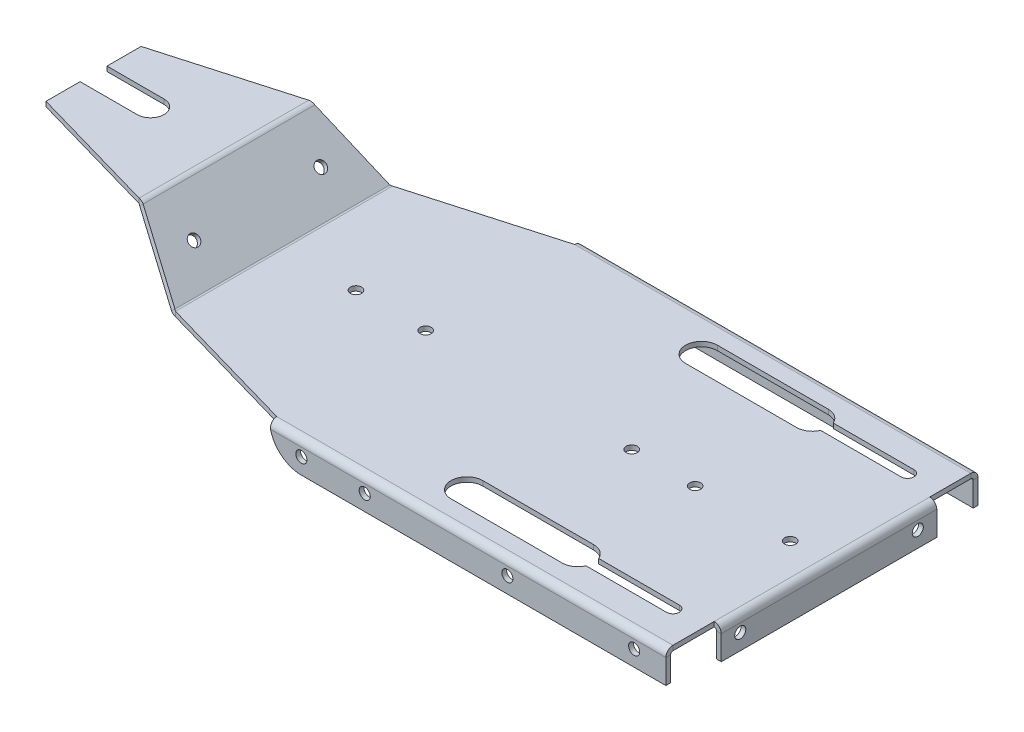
ISO-10303-21;
HEADER;
FILE_DESCRIPTION(('STEP AP214'),'2;1');
FILE_NAME('part.step','',(''),(''),'','','');
FILE_SCHEMA(('AUTOMOTIVE_DESIGN { 1 0 10303 214 1 1 1 1 }'));
ENDSEC;
DATA;
#1=APPLICATION_CONTEXT('core data for automotive mechanical design processes');
#2=APPLICATION_PROTOCOL_DEFINITION('international standard','automotive_design',2000,#1);
#3=PRODUCT_CONTEXT('',#1,'mechanical');
#4=PRODUCT('Part','Part','',(#3));
#5=PRODUCT_RELATED_PRODUCT_CATEGORY('part','',(#4));
#6=PRODUCT_DEFINITION_FORMATION('','',#4);
#7=PRODUCT_DEFINITION_CONTEXT('part definition',#1,'design');
#8=PRODUCT_DEFINITION('design','',#6,#7);
#9=PRODUCT_DEFINITION_SHAPE('','',#8);
#10=(LENGTH_UNIT() NAMED_UNIT(*) SI_UNIT(.MILLI.,.METRE.));
#11=(NAMED_UNIT(*) PLANE_ANGLE_UNIT() SI_UNIT($,.RADIAN.));
#12=(NAMED_UNIT(*) SI_UNIT($,.STERADIAN.) SOLID_ANGLE_UNIT());
#13=UNCERTAINTY_MEASURE_WITH_UNIT(LENGTH_MEASURE(1.E-05),#10,'distance_accuracy_value','');
#14=(GEOMETRIC_REPRESENTATION_CONTEXT(3) GLOBAL_UNCERTAINTY_ASSIGNED_CONTEXT((#13)) GLOBAL_UNIT_ASSIGNED_CONTEXT((#10,
#11,#12)) REPRESENTATION_CONTEXT('',''));
#15=CARTESIAN_POINT('',(0.,0.,0.));
#16=DIRECTION('',(0.,0.,1.));
#17=DIRECTION('',(1.,0.,0.));
#18=AXIS2_PLACEMENT_3D('',#15,#16,#17);
#19=CARTESIAN_POINT('',(-115.,-1.5,-9.99999999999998));
#20=DIRECTION('',(0.,1.,0.));
#21=DIRECTION('',(0.,0.,1.));
#22=AXIS2_PLACEMENT_3D('',#19,#20,#21);
#23=PLANE('',#22);
#24=DIRECTION('',(-1.,0.,0.));
#25=VECTOR('',#24,1.);
#26=CARTESIAN_POINT('',(-75.,-1.5,-99.));
#27=LINE('',#26,#25);
#28=CARTESIAN_POINT('',(-40.,-1.5,-99.));
#29=VERTEX_POINT('',#28);
#30=CARTESIAN_POINT('',(-75.,-1.5,-99.));
#31=VERTEX_POINT('',#30);
#32=EDGE_CURVE('E893',#29,#31,#27,.T.);
#33=ORIENTED_EDGE('',*,*,#32,.T.);
#34=CARTESIAN_POINT('',(-75.,-1.5,-94.));
#35=DIRECTION('',(0.,1.,0.));
#36=DIRECTION('',(0.,0.,-1.));
#37=AXIS2_PLACEMENT_3D('',#34,#35,#36);
#38=CIRCLE('',#37,4.99999999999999);
#39=CARTESIAN_POINT('',(-75.,-1.5,-89.));
#40=VERTEX_POINT('',#39);
#41=EDGE_CURVE('E890',#31,#40,#38,.T.);
#42=ORIENTED_EDGE('',*,*,#41,.T.);
#43=DIRECTION('',(1.,0.,0.));
#44=VECTOR('',#43,1.);
#45=CARTESIAN_POINT('',(-75.,-1.5,-89.));
#46=LINE('',#45,#44);
#47=CARTESIAN_POINT('',(-40.,-1.5,-89.));
#48=VERTEX_POINT('',#47);
#49=EDGE_CURVE('E887',#40,#48,#46,.T.);
#50=ORIENTED_EDGE('',*,*,#49,.T.);
#51=CARTESIAN_POINT('',(-40.,-1.5,-94.));
#52=DIRECTION('',(0.,1.,0.));
#53=DIRECTION('',(0.,0.,-1.));
#54=AXIS2_PLACEMENT_3D('',#51,#52,#53);
#55=CIRCLE('',#54,4.99999999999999);
#56=CARTESIAN_POINT('',(-35.4174243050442,-1.5,-92.));
#57=VERTEX_POINT('',#56);
#58=EDGE_CURVE('E884',#48,#57,#55,.T.);
#59=ORIENTED_EDGE('',*,*,#58,.T.);
#60=DIRECTION('',(1.,0.,0.));
#61=VECTOR('',#60,1.);
#62=CARTESIAN_POINT('',(-10.,-1.5,-92.));
#63=LINE('',#62,#61);
#64=CARTESIAN_POINT('',(-10.,-1.5,-92.));
#65=VERTEX_POINT('',#64);
#66=EDGE_CURVE('E881',#57,#65,#63,.T.);
#67=ORIENTED_EDGE('',*,*,#66,.T.);
#68=CARTESIAN_POINT('',(-10.,-1.5,-94.));
#69=DIRECTION('',(0.,1.,0.));
#70=DIRECTION('',(0.,0.,-1.));
#71=AXIS2_PLACEMENT_3D('',#68,#69,#70);
#72=CIRCLE('',#71,1.99999999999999);
#73=CARTESIAN_POINT('',(-10.,-1.5,-96.));
#74=VERTEX_POINT('',#73);
#75=EDGE_CURVE('E878',#65,#74,#72,.T.);
#76=ORIENTED_EDGE('',*,*,#75,.T.);
#77=DIRECTION('',(-1.,0.,0.));
#78=VECTOR('',#77,1.);
#79=CARTESIAN_POINT('',(-10.,-1.5,-96.));
#80=LINE('',#79,#78);
#81=CARTESIAN_POINT('',(-35.4174243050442,-1.5,-96.));
#82=VERTEX_POINT('',#81);
#83=EDGE_CURVE('E875',#74,#82,#80,.T.);
#84=ORIENTED_EDGE('',*,*,#83,.T.);
#85=CARTESIAN_POINT('',(-40.,-1.5,-94.));
#86=DIRECTION('',(0.,1.,0.));
#87=DIRECTION('',(0.,0.,-1.));
#88=AXIS2_PLACEMENT_3D('',#85,#86,#87);
#89=CIRCLE('',#88,4.99999999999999);
#90=EDGE_CURVE('E872',#82,#29,#89,.T.);
#91=ORIENTED_EDGE('',*,*,#90,.T.);
#92=EDGE_LOOP('',(#33,#42,#50,#59,#67,#76,#84,#91));
#93=FACE_BOUND('',#92,.T.);
#94=DIRECTION('',(-1.,0.,0.));
#95=VECTOR('',#94,1.);
#96=CARTESIAN_POINT('',(-75.,-1.5,-25.));
#97=LINE('',#96,#95);
#98=CARTESIAN_POINT('',(-40.,-1.5,-25.));
#99=VERTEX_POINT('',#98);
#100=CARTESIAN_POINT('',(-75.,-1.5,-25.));
#101=VERTEX_POINT('',#100);
#102=EDGE_CURVE('E917',#99,#101,#97,.T.);
#103=ORIENTED_EDGE('',*,*,#102,.T.);
#104=CARTESIAN_POINT('',(-75.,-1.5,-20.));
#105=DIRECTION('',(0.,1.,0.));
#106=DIRECTION('',(0.,0.,1.));
#107=AXIS2_PLACEMENT_3D('',#104,#105,#106);
#108=CIRCLE('',#107,5.);
#109=CARTESIAN_POINT('',(-75.,-1.5,-15.));
#110=VERTEX_POINT('',#109);
#111=EDGE_CURVE('E914',#101,#110,#108,.T.);
#112=ORIENTED_EDGE('',*,*,#111,.T.);
#113=DIRECTION('',(1.,0.,0.));
#114=VECTOR('',#113,1.);
#115=CARTESIAN_POINT('',(-75.,-1.5,-15.));
#116=LINE('',#115,#114);
#117=CARTESIAN_POINT('',(-40.,-1.5,-15.));
#118=VERTEX_POINT('',#117);
#119=EDGE_CURVE('E911',#110,#118,#116,.T.);
#120=ORIENTED_EDGE('',*,*,#119,.T.);
#121=CARTESIAN_POINT('',(-40.,-1.5,-20.));
#122=DIRECTION('',(0.,1.,0.));
#123=DIRECTION('',(0.,0.,1.));
#124=AXIS2_PLACEMENT_3D('',#121,#122,#123);
#125=CIRCLE('',#124,5.);
#126=CARTESIAN_POINT('',(-35.4174243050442,-1.5,-18.));
#127=VERTEX_POINT('',#126);
#128=EDGE_CURVE('E908',#118,#127,#125,.T.);
#129=ORIENTED_EDGE('',*,*,#128,.T.);
#130=DIRECTION('',(1.,0.,0.));
#131=VECTOR('',#130,1.);
#132=CARTESIAN_POINT('',(-10.,-1.5,-18.));
#133=LINE('',#132,#131);
#134=CARTESIAN_POINT('',(-10.,-1.5,-18.));
#135=VERTEX_POINT('',#134);
#136=EDGE_CURVE('E905',#127,#135,#133,.T.);
#137=ORIENTED_EDGE('',*,*,#136,.T.);
#138=CARTESIAN_POINT('',(-10.,-1.5,-20.));
#139=DIRECTION('',(0.,1.,0.));
#140=DIRECTION('',(0.,0.,1.));
#141=AXIS2_PLACEMENT_3D('',#138,#139,#140);
#142=CIRCLE('',#141,2.);
#143=CARTESIAN_POINT('',(-10.,-1.5,-22.));
#144=VERTEX_POINT('',#143);
#145=EDGE_CURVE('E902',#135,#144,#142,.T.);
#146=ORIENTED_EDGE('',*,*,#145,.T.);
#147=DIRECTION('',(-1.,0.,0.));
#148=VECTOR('',#147,1.);
#149=CARTESIAN_POINT('',(-10.,-1.5,-22.));
#150=LINE('',#149,#148);
#151=CARTESIAN_POINT('',(-35.4174243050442,-1.5,-22.));
#152=VERTEX_POINT('',#151);
#153=EDGE_CURVE('E899',#144,#152,#150,.T.);
#154=ORIENTED_EDGE('',*,*,#153,.T.);
#155=CARTESIAN_POINT('',(-40.,-1.5,-20.));
#156=DIRECTION('',(0.,1.,0.));
#157=DIRECTION('',(0.,0.,1.));
#158=AXIS2_PLACEMENT_3D('',#155,#156,#157);
#159=CIRCLE('',#158,5.);
#160=EDGE_CURVE('E896',#152,#99,#159,.T.);
#161=ORIENTED_EDGE('',*,*,#160,.T.);
#162=EDGE_LOOP('',(#103,#112,#120,#129,#137,#146,#154,#161));
#163=FACE_BOUND('',#162,.T.);
#164=CARTESIAN_POINT('',(-10.,-1.5,-57.));
#165=DIRECTION('',(0.,1.,0.));
#166=DIRECTION('',(0.,0.,1.));
#167=AXIS2_PLACEMENT_3D('',#164,#165,#166);
#168=CIRCLE('',#167,1.75);
#169=CARTESIAN_POINT('',(-10.,-1.5,-55.25));
#170=VERTEX_POINT('',#169);
#171=EDGE_CURVE('E920',#170,#170,#168,.T.);
#172=ORIENTED_EDGE('',*,*,#171,.T.);
#173=EDGE_LOOP('',(#172));
#174=FACE_BOUND('',#173,.T.);
#175=CARTESIAN_POINT('',(-40.,-1.5,-57.));
#176=DIRECTION('',(0.,1.,0.));
#177=DIRECTION('',(0.,0.,1.));
#178=AXIS2_PLACEMENT_3D('',#175,#176,#177);
#179=CIRCLE('',#178,1.75);
#180=CARTESIAN_POINT('',(-40.,-1.5,-55.25));
#181=VERTEX_POINT('',#180);
#182=EDGE_CURVE('E923',#181,#181,#179,.T.);
#183=ORIENTED_EDGE('',*,*,#182,.T.);
#184=EDGE_LOOP('',(#183));
#185=FACE_BOUND('',#184,.T.);
#186=CARTESIAN_POINT('',(-60.,-1.5,-57.));
#187=DIRECTION('',(0.,1.,0.));
#188=DIRECTION('',(0.,0.,1.));
#189=AXIS2_PLACEMENT_3D('',#186,#187,#188);
#190=CIRCLE('',#189,1.75);
#191=CARTESIAN_POINT('',(-60.,-1.5,-55.25));
#192=VERTEX_POINT('',#191);
#193=EDGE_CURVE('E926',#192,#192,#190,.T.);
#194=ORIENTED_EDGE('',*,*,#193,.T.);
#195=EDGE_LOOP('',(#194));
#196=FACE_BOUND('',#195,.T.);
#197=CARTESIAN_POINT('',(-147.,-1.5,-57.));
#198=DIRECTION('',(0.,1.,0.));
#199=DIRECTION('',(0.,0.,1.));
#200=AXIS2_PLACEMENT_3D('',#197,#198,#199);
#201=CIRCLE('',#200,1.75000000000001);
#202=CARTESIAN_POINT('',(-147.,-1.5,-55.25));
#203=VERTEX_POINT('',#202);
#204=EDGE_CURVE('E929',#203,#203,#201,.T.);
#205=ORIENTED_EDGE('',*,*,#204,.T.);
#206=EDGE_LOOP('',(#205));
#207=FACE_BOUND('',#206,.T.);
#208=CARTESIAN_POINT('',(-125.,-1.5,-57.));
#209=DIRECTION('',(0.,1.,0.));
#210=DIRECTION('',(0.,0.,1.));
#211=AXIS2_PLACEMENT_3D('',#208,#209,#210);
#212=CIRCLE('',#211,1.75);
#213=CARTESIAN_POINT('',(-125.,-1.5,-55.25));
#214=VERTEX_POINT('',#213);
#215=EDGE_CURVE('E932',#214,#214,#212,.T.);
#216=ORIENTED_EDGE('',*,*,#215,.T.);
#217=EDGE_LOOP('',(#216));
#218=FACE_BOUND('',#217,.T.);
#219=DIRECTION('',(0.,0.,-1.));
#220=VECTOR('',#219,1.);
#221=CARTESIAN_POINT('',(0.,-1.5,0.));
#222=LINE('',#221,#220);
#223=CARTESIAN_POINT('',(0.,-1.5,-9.99999999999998));
#224=VERTEX_POINT('',#223);
#225=CARTESIAN_POINT('',(0.,-1.5,-23.));
#226=VERTEX_POINT('',#225);
#227=EDGE_CURVE('E1146',#224,#226,#222,.T.);
#228=ORIENTED_EDGE('',*,*,#227,.F.);
#229=DIRECTION('',(-1.,0.,0.));
#230=VECTOR('',#229,1.);
#231=CARTESIAN_POINT('',(-115.,-1.5,-9.99999999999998));
#232=LINE('',#231,#230);
#233=CARTESIAN_POINT('',(-125.,-1.5,-9.99999999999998));
#234=VERTEX_POINT('',#233);
#235=EDGE_CURVE('E1151',#224,#234,#232,.T.);
#236=ORIENTED_EDGE('',*,*,#235,.T.);
#237=DIRECTION('',(0.961523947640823,0.,0.274721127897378));
#238=VECTOR('',#237,1.);
#239=CARTESIAN_POINT('',(-237.,-1.5,-42.));
#240=LINE('',#239,#238);
#241=CARTESIAN_POINT('',(-169.694890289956,-1.5,-22.7699686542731));
#242=VERTEX_POINT('',#241);
#243=EDGE_CURVE('E846',#242,#234,#240,.T.);
#244=ORIENTED_EDGE('',*,*,#243,.F.);
#245=DIRECTION('',(0.,0.,-1.));
#246=VECTOR('',#245,1.);
#247=CARTESIAN_POINT('',(-169.694890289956,-1.5,-9.99999999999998));
#248=LINE('',#247,#246);
#249=CARTESIAN_POINT('',(-169.694890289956,-1.5,-91.2300313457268));
#250=VERTEX_POINT('',#249);
#251=EDGE_CURVE('E869',#242,#250,#248,.T.);
#252=ORIENTED_EDGE('',*,*,#251,.T.);
#253=DIRECTION('',(-0.961523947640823,0.,0.274721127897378));
#254=VECTOR('',#253,1.);
#255=CARTESIAN_POINT('',(-237.,-1.5,-72.));
#256=LINE('',#255,#254);
#257=CARTESIAN_POINT('',(-125.,-1.5,-104.));
#258=VERTEX_POINT('',#257);
#259=EDGE_CURVE('E865',#258,#250,#256,.T.);
#260=ORIENTED_EDGE('',*,*,#259,.F.);
#261=DIRECTION('',(-1.,0.,0.));
#262=VECTOR('',#261,1.);
#263=CARTESIAN_POINT('',(-115.,-1.5,-104.));
#264=LINE('',#263,#262);
#265=CARTESIAN_POINT('',(0.,-1.50000000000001,-104.));
#266=VERTEX_POINT('',#265);
#267=EDGE_CURVE('E1297',#266,#258,#264,.T.);
#268=ORIENTED_EDGE('',*,*,#267,.F.);
#269=DIRECTION('',(0.,0.,-1.));
#270=VECTOR('',#269,1.);
#271=CARTESIAN_POINT('',(0.,-1.5,-91.));
#272=LINE('',#271,#270);
#273=CARTESIAN_POINT('',(0.,-1.5,-91.));
#274=VERTEX_POINT('',#273);
#275=EDGE_CURVE('E1030',#274,#266,#272,.T.);
#276=ORIENTED_EDGE('',*,*,#275,.F.);
#277=DIRECTION('',(0.,0.,-1.));
#278=VECTOR('',#277,1.);
#279=CARTESIAN_POINT('',(0.,-1.5,-9.99999999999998));
#280=LINE('',#279,#278);
#281=EDGE_CURVE('E1257',#226,#274,#280,.T.);
#282=ORIENTED_EDGE('',*,*,#281,.F.);
#283=EDGE_LOOP('',(#228,#236,#244,#252,#260,#268,#276,#282));
#284=FACE_BOUND('',#283,.T.);
#285=ADVANCED_FACE('F93',(#93,#163,#174,#185,#196,#207,#218,#284),#23,.F.);
#286=CARTESIAN_POINT('',(-115.,0.,-9.99999999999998));
#287=DIRECTION('',(0.,1.,0.));
#288=DIRECTION('',(0.,0.,1.));
#289=AXIS2_PLACEMENT_3D('',#286,#287,#288);
#290=PLANE('',#289);
#291=DIRECTION('',(-1.,0.,0.));
#292=VECTOR('',#291,1.);
#293=CARTESIAN_POINT('',(-115.,0.,-9.99999999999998));
#294=LINE('',#293,#292);
#295=CARTESIAN_POINT('',(0.,0.,-9.99999999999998));
#296=VERTEX_POINT('',#295);
#297=CARTESIAN_POINT('',(-125.,0.,-9.99999999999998));
#298=VERTEX_POINT('',#297);
#299=EDGE_CURVE('E104',#296,#298,#294,.T.);
#300=ORIENTED_EDGE('',*,*,#299,.F.);
#301=DIRECTION('',(0.,0.,-1.));
#302=VECTOR('',#301,1.);
#303=CARTESIAN_POINT('',(0.,0.,0.));
#304=LINE('',#303,#302);
#305=CARTESIAN_POINT('',(0.,0.,-23.));
#306=VERTEX_POINT('',#305);
#307=EDGE_CURVE('E864',#296,#306,#304,.T.);
#308=ORIENTED_EDGE('',*,*,#307,.T.);
#309=DIRECTION('',(0.,0.,-1.));
#310=VECTOR('',#309,1.);
#311=CARTESIAN_POINT('',(0.,0.,-9.99999999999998));
#312=LINE('',#311,#310);
#313=CARTESIAN_POINT('',(0.,0.,-91.));
#314=VERTEX_POINT('',#313);
#315=EDGE_CURVE('E1265',#306,#314,#312,.T.);
#316=ORIENTED_EDGE('',*,*,#315,.T.);
#317=DIRECTION('',(0.,0.,-1.));
#318=VECTOR('',#317,1.);
#319=CARTESIAN_POINT('',(0.,0.,-91.));
#320=LINE('',#319,#318);
#321=CARTESIAN_POINT('',(0.,0.,-104.));
#322=VERTEX_POINT('',#321);
#323=EDGE_CURVE('E859',#314,#322,#320,.T.);
#324=ORIENTED_EDGE('',*,*,#323,.T.);
#325=DIRECTION('',(-1.,0.,0.));
#326=VECTOR('',#325,1.);
#327=CARTESIAN_POINT('',(-115.,0.,-104.));
#328=LINE('',#327,#326);
#329=CARTESIAN_POINT('',(-125.,0.,-104.));
#330=VERTEX_POINT('',#329);
#331=EDGE_CURVE('E1065',#322,#330,#328,.T.);
#332=ORIENTED_EDGE('',*,*,#331,.T.);
#333=DIRECTION('',(-0.961523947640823,0.,0.274721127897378));
#334=VECTOR('',#333,1.);
#335=CARTESIAN_POINT('',(-237.,0.,-72.));
#336=LINE('',#335,#334);
#337=CARTESIAN_POINT('',(-169.694890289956,0.,-91.2300313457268));
#338=VERTEX_POINT('',#337);
#339=EDGE_CURVE('E855',#330,#338,#336,.T.);
#340=ORIENTED_EDGE('',*,*,#339,.T.);
#341=DIRECTION('',(0.,0.,-1.));
#342=VECTOR('',#341,1.);
#343=CARTESIAN_POINT('',(-169.694890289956,0.,-9.99999999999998));
#344=LINE('',#343,#342);
#345=CARTESIAN_POINT('',(-169.694890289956,0.,-22.7699686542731));
#346=VERTEX_POINT('',#345);
#347=EDGE_CURVE('E1042',#346,#338,#344,.T.);
#348=ORIENTED_EDGE('',*,*,#347,.F.);
#349=DIRECTION('',(0.961523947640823,0.,0.274721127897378));
#350=VECTOR('',#349,1.);
#351=CARTESIAN_POINT('',(-237.,0.,-42.));
#352=LINE('',#351,#350);
#353=EDGE_CURVE('E862',#346,#298,#352,.T.);
#354=ORIENTED_EDGE('',*,*,#353,.T.);
#355=EDGE_LOOP('',(#300,#308,#316,#324,#332,#340,#348,#354));
#356=FACE_BOUND('',#355,.T.);
#357=CARTESIAN_POINT('',(-75.,0.,-94.));
#358=DIRECTION('',(0.,1.,0.));
#359=DIRECTION('',(0.,0.,-1.));
#360=AXIS2_PLACEMENT_3D('',#357,#358,#359);
#361=CIRCLE('',#360,4.99999999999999);
#362=CARTESIAN_POINT('',(-75.,0.,-99.));
#363=VERTEX_POINT('',#362);
#364=CARTESIAN_POINT('',(-75.,0.,-89.));
#365=VERTEX_POINT('',#364);
#366=EDGE_CURVE('E997',#363,#365,#361,.T.);
#367=ORIENTED_EDGE('',*,*,#366,.F.);
#368=DIRECTION('',(-1.,0.,0.));
#369=VECTOR('',#368,1.);
#370=CARTESIAN_POINT('',(-75.,0.,-99.));
#371=LINE('',#370,#369);
#372=CARTESIAN_POINT('',(-40.,0.,-99.));
#373=VERTEX_POINT('',#372);
#374=EDGE_CURVE('E992',#373,#363,#371,.T.);
#375=ORIENTED_EDGE('',*,*,#374,.F.);
#376=CARTESIAN_POINT('',(-40.,0.,-94.));
#377=DIRECTION('',(0.,1.,0.));
#378=DIRECTION('',(0.,0.,-1.));
#379=AXIS2_PLACEMENT_3D('',#376,#377,#378);
#380=CIRCLE('',#379,4.99999999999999);
#381=CARTESIAN_POINT('',(-35.4174243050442,0.,-96.));
#382=VERTEX_POINT('',#381);
#383=EDGE_CURVE('E1027',#382,#373,#380,.T.);
#384=ORIENTED_EDGE('',*,*,#383,.F.);
#385=DIRECTION('',(-1.,0.,0.));
#386=VECTOR('',#385,1.);
#387=CARTESIAN_POINT('',(-10.,0.,-96.));
#388=LINE('',#387,#386);
#389=CARTESIAN_POINT('',(-10.,0.,-96.));
#390=VERTEX_POINT('',#389);
#391=EDGE_CURVE('E1022',#390,#382,#388,.T.);
#392=ORIENTED_EDGE('',*,*,#391,.F.);
#393=CARTESIAN_POINT('',(-10.,0.,-94.));
#394=DIRECTION('',(0.,1.,0.));
#395=DIRECTION('',(0.,0.,-1.));
#396=AXIS2_PLACEMENT_3D('',#393,#394,#395);
#397=CIRCLE('',#396,1.99999999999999);
#398=CARTESIAN_POINT('',(-10.,0.,-92.));
#399=VERTEX_POINT('',#398);
#400=EDGE_CURVE('E1017',#399,#390,#397,.T.);
#401=ORIENTED_EDGE('',*,*,#400,.F.);
#402=DIRECTION('',(1.,0.,0.));
#403=VECTOR('',#402,1.);
#404=CARTESIAN_POINT('',(-10.,0.,-92.));
#405=LINE('',#404,#403);
#406=CARTESIAN_POINT('',(-35.4174243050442,0.,-92.));
#407=VERTEX_POINT('',#406);
#408=EDGE_CURVE('E1012',#407,#399,#405,.T.);
#409=ORIENTED_EDGE('',*,*,#408,.F.);
#410=CARTESIAN_POINT('',(-40.,0.,-94.));
#411=DIRECTION('',(0.,1.,0.));
#412=DIRECTION('',(0.,0.,-1.));
#413=AXIS2_PLACEMENT_3D('',#410,#411,#412);
#414=CIRCLE('',#413,4.99999999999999);
#415=CARTESIAN_POINT('',(-40.,0.,-89.));
#416=VERTEX_POINT('',#415);
#417=EDGE_CURVE('E1007',#416,#407,#414,.T.);
#418=ORIENTED_EDGE('',*,*,#417,.F.);
#419=DIRECTION('',(1.,0.,0.));
#420=VECTOR('',#419,1.);
#421=CARTESIAN_POINT('',(-75.,0.,-89.));
#422=LINE('',#421,#420);
#423=EDGE_CURVE('E1002',#365,#416,#422,.T.);
#424=ORIENTED_EDGE('',*,*,#423,.F.);
#425=EDGE_LOOP('',(#367,#375,#384,#392,#401,#409,#418,#424));
#426=FACE_BOUND('',#425,.T.);
#427=CARTESIAN_POINT('',(-75.,0.,-20.));
#428=DIRECTION('',(0.,1.,0.));
#429=DIRECTION('',(0.,0.,1.));
#430=AXIS2_PLACEMENT_3D('',#427,#428,#429);
#431=CIRCLE('',#430,5.);
#432=CARTESIAN_POINT('',(-75.,0.,-25.));
#433=VERTEX_POINT('',#432);
#434=CARTESIAN_POINT('',(-75.,0.,-15.));
#435=VERTEX_POINT('',#434);
#436=EDGE_CURVE('E957',#433,#435,#431,.T.);
#437=ORIENTED_EDGE('',*,*,#436,.F.);
#438=DIRECTION('',(-1.,0.,0.));
#439=VECTOR('',#438,1.);
#440=CARTESIAN_POINT('',(-75.,0.,-25.));
#441=LINE('',#440,#439);
#442=CARTESIAN_POINT('',(-40.,0.,-25.));
#443=VERTEX_POINT('',#442);
#444=EDGE_CURVE('E952',#443,#433,#441,.T.);
#445=ORIENTED_EDGE('',*,*,#444,.F.);
#446=CARTESIAN_POINT('',(-40.,0.,-20.));
#447=DIRECTION('',(0.,1.,0.));
#448=DIRECTION('',(0.,0.,1.));
#449=AXIS2_PLACEMENT_3D('',#446,#447,#448);
#450=CIRCLE('',#449,5.);
#451=CARTESIAN_POINT('',(-35.4174243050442,0.,-22.));
#452=VERTEX_POINT('',#451);
#453=EDGE_CURVE('E987',#452,#443,#450,.T.);
#454=ORIENTED_EDGE('',*,*,#453,.F.);
#455=DIRECTION('',(-1.,0.,0.));
#456=VECTOR('',#455,1.);
#457=CARTESIAN_POINT('',(-10.,0.,-22.));
#458=LINE('',#457,#456);
#459=CARTESIAN_POINT('',(-10.,0.,-22.));
#460=VERTEX_POINT('',#459);
#461=EDGE_CURVE('E982',#460,#452,#458,.T.);
#462=ORIENTED_EDGE('',*,*,#461,.F.);
#463=CARTESIAN_POINT('',(-10.,0.,-20.));
#464=DIRECTION('',(0.,1.,0.));
#465=DIRECTION('',(0.,0.,1.));
#466=AXIS2_PLACEMENT_3D('',#463,#464,#465);
#467=CIRCLE('',#466,2.);
#468=CARTESIAN_POINT('',(-10.,0.,-18.));
#469=VERTEX_POINT('',#468);
#470=EDGE_CURVE('E977',#469,#460,#467,.T.);
#471=ORIENTED_EDGE('',*,*,#470,.F.);
#472=DIRECTION('',(1.,0.,0.));
#473=VECTOR('',#472,1.);
#474=CARTESIAN_POINT('',(-10.,0.,-18.));
#475=LINE('',#474,#473);
#476=CARTESIAN_POINT('',(-35.4174243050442,0.,-18.));
#477=VERTEX_POINT('',#476);
#478=EDGE_CURVE('E972',#477,#469,#475,.T.);
#479=ORIENTED_EDGE('',*,*,#478,.F.);
#480=CARTESIAN_POINT('',(-40.,0.,-20.));
#481=DIRECTION('',(0.,1.,0.));
#482=DIRECTION('',(0.,0.,1.));
#483=AXIS2_PLACEMENT_3D('',#480,#481,#482);
#484=CIRCLE('',#483,5.);
#485=CARTESIAN_POINT('',(-40.,0.,-15.));
#486=VERTEX_POINT('',#485);
#487=EDGE_CURVE('E967',#486,#477,#484,.T.);
#488=ORIENTED_EDGE('',*,*,#487,.F.);
#489=DIRECTION('',(1.,0.,0.));
#490=VECTOR('',#489,1.);
#491=CARTESIAN_POINT('',(-75.,0.,-15.));
#492=LINE('',#491,#490);
#493=EDGE_CURVE('E962',#435,#486,#492,.T.);
#494=ORIENTED_EDGE('',*,*,#493,.F.);
#495=EDGE_LOOP('',(#437,#445,#454,#462,#471,#479,#488,#494));
#496=FACE_BOUND('',#495,.T.);
#497=CARTESIAN_POINT('',(-10.,0.,-57.));
#498=DIRECTION('',(0.,1.,0.));
#499=DIRECTION('',(0.,0.,1.));
#500=AXIS2_PLACEMENT_3D('',#497,#498,#499);
#501=CIRCLE('',#500,1.75);
#502=CARTESIAN_POINT('',(-10.,0.,-55.25));
#503=VERTEX_POINT('',#502);
#504=EDGE_CURVE('E947',#503,#503,#501,.T.);
#505=ORIENTED_EDGE('',*,*,#504,.F.);
#506=EDGE_LOOP('',(#505));
#507=FACE_BOUND('',#506,.T.);
#508=CARTESIAN_POINT('',(-40.,0.,-57.));
#509=DIRECTION('',(0.,1.,0.));
#510=DIRECTION('',(0.,0.,1.));
#511=AXIS2_PLACEMENT_3D('',#508,#509,#510);
#512=CIRCLE('',#511,1.75);
#513=CARTESIAN_POINT('',(-40.,0.,-55.25));
#514=VERTEX_POINT('',#513);
#515=EDGE_CURVE('E944',#514,#514,#512,.T.);
#516=ORIENTED_EDGE('',*,*,#515,.F.);
#517=EDGE_LOOP('',(#516));
#518=FACE_BOUND('',#517,.T.);
#519=CARTESIAN_POINT('',(-60.,0.,-57.));
#520=DIRECTION('',(0.,1.,0.));
#521=DIRECTION('',(0.,0.,1.));
#522=AXIS2_PLACEMENT_3D('',#519,#520,#521);
#523=CIRCLE('',#522,1.75);
#524=CARTESIAN_POINT('',(-60.,0.,-55.25));
#525=VERTEX_POINT('',#524);
#526=EDGE_CURVE('E941',#525,#525,#523,.T.);
#527=ORIENTED_EDGE('',*,*,#526,.F.);
#528=EDGE_LOOP('',(#527));
#529=FACE_BOUND('',#528,.T.);
#530=CARTESIAN_POINT('',(-147.,0.,-57.));
#531=DIRECTION('',(0.,1.,0.));
#532=DIRECTION('',(0.,0.,1.));
#533=AXIS2_PLACEMENT_3D('',#530,#531,#532);
#534=CIRCLE('',#533,1.75000000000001);
#535=CARTESIAN_POINT('',(-147.,0.,-55.25));
#536=VERTEX_POINT('',#535);
#537=EDGE_CURVE('E938',#536,#536,#534,.T.);
#538=ORIENTED_EDGE('',*,*,#537,.F.);
#539=EDGE_LOOP('',(#538));
#540=FACE_BOUND('',#539,.T.);
#541=CARTESIAN_POINT('',(-125.,0.,-57.));
#542=DIRECTION('',(0.,1.,0.));
#543=DIRECTION('',(0.,0.,1.));
#544=AXIS2_PLACEMENT_3D('',#541,#542,#543);
#545=CIRCLE('',#544,1.75);
#546=CARTESIAN_POINT('',(-125.,0.,-55.25));
#547=VERTEX_POINT('',#546);
#548=EDGE_CURVE('E935',#547,#547,#545,.T.);
#549=ORIENTED_EDGE('',*,*,#548,.F.);
#550=EDGE_LOOP('',(#549));
#551=FACE_BOUND('',#550,.T.);
#552=ADVANCED_FACE('F95',(#356,#426,#496,#507,#518,#529,#540,#551),#290,.T.);
#553=CARTESIAN_POINT('',(0.,-1.5,-91.));
#554=DIRECTION('',(1.,0.,0.));
#555=DIRECTION('',(0.,0.,-1.));
#556=AXIS2_PLACEMENT_3D('',#553,#554,#555);
#557=PLANE('',#556);
#558=ORIENTED_EDGE('',*,*,#275,.T.);
#559=DIRECTION('',(0.,1.,0.));
#560=VECTOR('',#559,1.);
#561=CARTESIAN_POINT('',(0.,-1.5,-104.));
#562=LINE('',#561,#560);
#563=EDGE_CURVE('E1073',#266,#322,#562,.T.);
#564=ORIENTED_EDGE('',*,*,#563,.T.);
#565=ORIENTED_EDGE('',*,*,#323,.F.);
#566=DIRECTION('',(0.,1.,0.));
#567=VECTOR('',#566,1.);
#568=CARTESIAN_POINT('',(0.,-1.5,-91.));
#569=LINE('',#568,#567);
#570=EDGE_CURVE('E1263',#274,#314,#569,.T.);
#571=ORIENTED_EDGE('',*,*,#570,.F.);
#572=EDGE_LOOP('',(#558,#564,#565,#571));
#573=FACE_BOUND('',#572,.T.);
#574=ADVANCED_FACE('F1121',(#573),#557,.T.);
#575=CARTESIAN_POINT('',(-218.042706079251,45.9213857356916,-72.));
#576=DIRECTION('',(-0.194257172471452,0.194257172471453,-0.961523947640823));
#577=DIRECTION('',(-0.679900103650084,0.679900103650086,0.274721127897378));
#578=AXIS2_PLACEMENT_3D('',#575,#576,#577);
#579=PLANE('',#578);
#580=DIRECTION('',(-0.679900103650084,0.679900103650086,0.274721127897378));
#581=VECTOR('',#580,1.);
#582=CARTESIAN_POINT('',(-216.982045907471,46.9820459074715,-72.));
#583=LINE('',#582,#581);
#584=CARTESIAN_POINT('',(-170.215745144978,0.215745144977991,-90.8964390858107));
#585=VERTEX_POINT('',#584);
#586=CARTESIAN_POINT('',(-187.067815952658,17.0678159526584,-84.0871742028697));
#587=VERTEX_POINT('',#586);
#588=EDGE_CURVE('E1359',#585,#587,#583,.T.);
#589=ORIENTED_EDGE('',*,*,#588,.F.);
#590=CARTESIAN_POINT('',(-171.276405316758,-0.844915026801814,-90.8964390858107));
#591=CARTESIAN_POINT('',(-170.215745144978,0.215745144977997,-90.8964390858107));
#592=B_SPLINE_CURVE_WITH_KNOTS('',1,(#590,#591),.UNSPECIFIED.,.F.,.F.,(2,2),(0.,1.),.UNSPECIFIED.);
#593=CARTESIAN_POINT('',(-171.276405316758,-0.844915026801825,-90.8964390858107));
#594=VERTEX_POINT('',#593);
#595=EDGE_CURVE('E1306',#585,#594,#592,.F.);
#596=ORIENTED_EDGE('',*,*,#595,.T.);
#597=DIRECTION('',(-0.679900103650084,0.679900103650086,0.274721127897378));
#598=VECTOR('',#597,1.);
#599=CARTESIAN_POINT('',(-218.042706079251,45.9213857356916,-72.));
#600=LINE('',#599,#598);
#601=CARTESIAN_POINT('',(-188.128476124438,16.0071557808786,-84.0871742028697));
#602=VERTEX_POINT('',#601);
#603=EDGE_CURVE('E1360',#594,#602,#600,.T.);
#604=ORIENTED_EDGE('',*,*,#603,.T.);
#605=CARTESIAN_POINT('',(-187.067815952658,17.0678159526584,-84.0871742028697));
#606=CARTESIAN_POINT('',(-188.128476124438,16.0071557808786,-84.0871742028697));
#607=B_SPLINE_CURVE_WITH_KNOTS('',1,(#605,#606),.UNSPECIFIED.,.F.,.F.,(2,2),(0.,1.),.UNSPECIFIED.);
#608=EDGE_CURVE('E1352',#587,#602,#607,.T.);
#609=ORIENTED_EDGE('',*,*,#608,.F.);
#610=EDGE_LOOP('',(#589,#596,#604,#609));
#611=FACE_BOUND('',#610,.T.);
#612=ADVANCED_FACE('F1323',(#611),#579,.T.);
#613=CARTESIAN_POINT('',(-130.715018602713,-39.2849813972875,-9.99999999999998));
#614=DIRECTION('',(0.707106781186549,0.707106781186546,0.));
#615=DIRECTION('',(0.,0.,1.));
#616=AXIS2_PLACEMENT_3D('',#613,#614,#615);
#617=PLANE('',#616);
#618=CARTESIAN_POINT('',(-178.091172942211,8.09117294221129,-77.));
#619=DIRECTION('',(0.707106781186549,0.707106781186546,0.));
#620=DIRECTION('',(0.,0.,1.));
#621=AXIS2_PLACEMENT_3D('',#618,#619,#620);
#622=CIRCLE('',#621,1.75000000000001);
#623=CARTESIAN_POINT('',(-178.091172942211,8.09117294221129,-75.25));
#624=VERTEX_POINT('',#623);
#625=EDGE_CURVE('E1620',#624,#624,#622,.T.);
#626=ORIENTED_EDGE('',*,*,#625,.F.);
#627=EDGE_LOOP('',(#626));
#628=FACE_BOUND('',#627,.T.);
#629=CARTESIAN_POINT('',(-178.091172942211,8.09117294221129,-37.));
#630=DIRECTION('',(0.707106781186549,0.707106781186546,0.));
#631=DIRECTION('',(0.,0.,1.));
#632=AXIS2_PLACEMENT_3D('',#629,#630,#631);
#633=CIRCLE('',#632,1.75000000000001);
#634=CARTESIAN_POINT('',(-178.091172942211,8.09117294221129,-35.25));
#635=VERTEX_POINT('',#634);
#636=EDGE_CURVE('E1617',#635,#635,#633,.T.);
#637=ORIENTED_EDGE('',*,*,#636,.F.);
#638=EDGE_LOOP('',(#637));
#639=FACE_BOUND('',#638,.T.);
#640=DIRECTION('',(0.679900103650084,-0.679900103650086,0.274721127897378));
#641=VECTOR('',#640,1.);
#642=CARTESIAN_POINT('',(-216.982045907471,46.9820459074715,-42.));
#643=LINE('',#642,#641);
#644=CARTESIAN_POINT('',(-187.067815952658,17.0678159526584,-29.9128257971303));
#645=VERTEX_POINT('',#644);
#646=CARTESIAN_POINT('',(-170.215745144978,0.215745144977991,-23.1035609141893));
#647=VERTEX_POINT('',#646);
#648=EDGE_CURVE('E1356',#645,#647,#643,.T.);
#649=ORIENTED_EDGE('',*,*,#648,.T.);
#650=DIRECTION('',(0.,0.,-1.));
#651=VECTOR('',#650,1.);
#652=CARTESIAN_POINT('',(-170.215745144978,0.215745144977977,-9.99999999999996));
#653=LINE('',#652,#651);
#654=EDGE_CURVE('E1301',#647,#585,#653,.T.);
#655=ORIENTED_EDGE('',*,*,#654,.T.);
#656=ORIENTED_EDGE('',*,*,#588,.T.);
#657=DIRECTION('',(0.,0.,-1.));
#658=VECTOR('',#657,1.);
#659=CARTESIAN_POINT('',(-187.067815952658,17.0678159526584,-9.99999999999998));
#660=LINE('',#659,#658);
#661=EDGE_CURVE('E1344',#645,#587,#660,.T.);
#662=ORIENTED_EDGE('',*,*,#661,.F.);
#663=EDGE_LOOP('',(#649,#655,#656,#662));
#664=FACE_BOUND('',#663,.T.);
#665=ADVANCED_FACE('F1333',(#628,#639,#664),#617,.T.);
#666=CARTESIAN_POINT('',(-218.042706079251,45.9213857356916,-42.));
#667=DIRECTION('',(-0.194257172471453,0.194257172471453,0.961523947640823));
#668=DIRECTION('',(0.679900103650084,-0.679900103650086,0.274721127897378));
#669=AXIS2_PLACEMENT_3D('',#666,#667,#668);
#670=PLANE('',#669);
#671=DIRECTION('',(0.679900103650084,-0.679900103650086,0.274721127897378));
#672=VECTOR('',#671,1.);
#673=CARTESIAN_POINT('',(-218.042706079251,45.9213857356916,-42.));
#674=LINE('',#673,#672);
#675=CARTESIAN_POINT('',(-188.128476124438,16.0071557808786,-29.9128257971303));
#676=VERTEX_POINT('',#675);
#677=CARTESIAN_POINT('',(-171.276405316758,-0.844915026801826,-23.1035609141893));
#678=VERTEX_POINT('',#677);
#679=EDGE_CURVE('E1377',#676,#678,#674,.T.);
#680=ORIENTED_EDGE('',*,*,#679,.T.);
#681=CARTESIAN_POINT('',(-170.215745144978,0.215745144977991,-23.1035609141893));
#682=CARTESIAN_POINT('',(-171.276405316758,-0.844915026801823,-23.1035609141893));
#683=B_SPLINE_CURVE_WITH_KNOTS('',1,(#681,#682),.UNSPECIFIED.,.F.,.F.,(2,2),(0.,1.),.UNSPECIFIED.);
#684=EDGE_CURVE('E1298',#678,#647,#683,.F.);
#685=ORIENTED_EDGE('',*,*,#684,.T.);
#686=ORIENTED_EDGE('',*,*,#648,.F.);
#687=CARTESIAN_POINT('',(-188.128476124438,16.0071557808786,-29.9128257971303));
#688=CARTESIAN_POINT('',(-187.067815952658,17.0678159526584,-29.9128257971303));
#689=B_SPLINE_CURVE_WITH_KNOTS('',1,(#687,#688),.UNSPECIFIED.,.F.,.F.,(2,2),(0.,1.),.UNSPECIFIED.);
#690=EDGE_CURVE('E1353',#676,#645,#689,.T.);
#691=ORIENTED_EDGE('',*,*,#690,.F.);
#692=EDGE_LOOP('',(#680,#685,#686,#691));
#693=FACE_BOUND('',#692,.T.);
#694=ADVANCED_FACE('F1463',(#693),#670,.T.);
#695=CARTESIAN_POINT('',(-229.786867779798,16.2229009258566,-42.));
#696=DIRECTION('',(-0.274721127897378,0.,0.961523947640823));
#697=DIRECTION('',(0.961523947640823,0.,0.274721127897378));
#698=AXIS2_PLACEMENT_3D('',#695,#696,#697);
#699=PLANE('',#698);
#700=DIRECTION('',(0.961523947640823,0.,0.274721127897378));
#701=VECTOR('',#700,1.);
#702=CARTESIAN_POINT('',(-229.786867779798,16.2229009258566,-42.));
#703=LINE('',#702,#701);
#704=CARTESIAN_POINT('',(-229.786867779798,16.2229009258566,-42.));
#705=VERTEX_POINT('',#704);
#706=CARTESIAN_POINT('',(-188.64933097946,16.2229009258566,-30.2464180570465));
#707=VERTEX_POINT('',#706);
#708=EDGE_CURVE('E1398',#705,#707,#703,.T.);
#709=ORIENTED_EDGE('',*,*,#708,.T.);
#710=CARTESIAN_POINT('',(-188.64933097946,17.7229009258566,-30.2464180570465));
#711=CARTESIAN_POINT('',(-188.64933097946,16.2229009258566,-30.2464180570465));
#712=B_SPLINE_CURVE_WITH_KNOTS('',1,(#710,#711),.UNSPECIFIED.,.F.,.F.,(2,2),(0.,1.),.UNSPECIFIED.);
#713=CARTESIAN_POINT('',(-188.64933097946,17.7229009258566,-30.2464180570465));
#714=VERTEX_POINT('',#713);
#715=EDGE_CURVE('E1446',#707,#714,#712,.F.);
#716=ORIENTED_EDGE('',*,*,#715,.T.);
#717=DIRECTION('',(0.961523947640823,0.,0.274721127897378));
#718=VECTOR('',#717,1.);
#719=CARTESIAN_POINT('',(-229.786867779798,17.7229009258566,-42.));
#720=LINE('',#719,#718);
#721=CARTESIAN_POINT('',(-229.786867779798,17.7229009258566,-42.));
#722=VERTEX_POINT('',#721);
#723=EDGE_CURVE('E1414',#722,#714,#720,.T.);
#724=ORIENTED_EDGE('',*,*,#723,.F.);
#725=DIRECTION('',(0.,1.,0.));
#726=VECTOR('',#725,1.);
#727=CARTESIAN_POINT('',(-229.786867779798,16.2229009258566,-42.));
#728=LINE('',#727,#726);
#729=EDGE_CURVE('E1415',#705,#722,#728,.T.);
#730=ORIENTED_EDGE('',*,*,#729,.F.);
#731=EDGE_LOOP('',(#709,#716,#724,#730));
#732=FACE_BOUND('',#731,.T.);
#733=ADVANCED_FACE('F1453',(#732),#699,.T.);
#734=CARTESIAN_POINT('',(-229.786867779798,16.2229009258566,-72.));
#735=DIRECTION('',(-0.274721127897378,0.,-0.961523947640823));
#736=DIRECTION('',(-0.961523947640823,0.,0.274721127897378));
#737=AXIS2_PLACEMENT_3D('',#734,#735,#736);
#738=PLANE('',#737);
#739=DIRECTION('',(-0.961523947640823,0.,0.274721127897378));
#740=VECTOR('',#739,1.);
#741=CARTESIAN_POINT('',(-229.786867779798,17.7229009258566,-72.));
#742=LINE('',#741,#740);
#743=CARTESIAN_POINT('',(-188.64933097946,17.7229009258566,-83.7535819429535));
#744=VERTEX_POINT('',#743);
#745=CARTESIAN_POINT('',(-229.786867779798,17.7229009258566,-72.));
#746=VERTEX_POINT('',#745);
#747=EDGE_CURVE('E1379',#744,#746,#742,.T.);
#748=ORIENTED_EDGE('',*,*,#747,.F.);
#749=CARTESIAN_POINT('',(-188.64933097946,16.2229009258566,-83.7535819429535));
#750=CARTESIAN_POINT('',(-188.64933097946,17.7229009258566,-83.7535819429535));
#751=B_SPLINE_CURVE_WITH_KNOTS('',1,(#749,#750),.UNSPECIFIED.,.F.,.F.,(2,2),(0.,1.),.UNSPECIFIED.);
#752=CARTESIAN_POINT('',(-188.64933097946,16.2229009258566,-83.7535819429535));
#753=VERTEX_POINT('',#752);
#754=EDGE_CURVE('E1434',#744,#753,#751,.F.);
#755=ORIENTED_EDGE('',*,*,#754,.T.);
#756=DIRECTION('',(-0.961523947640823,0.,0.274721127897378));
#757=VECTOR('',#756,1.);
#758=CARTESIAN_POINT('',(-229.786867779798,16.2229009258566,-72.));
#759=LINE('',#758,#757);
#760=CARTESIAN_POINT('',(-229.786867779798,16.2229009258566,-72.));
#761=VERTEX_POINT('',#760);
#762=EDGE_CURVE('E1386',#753,#761,#759,.T.);
#763=ORIENTED_EDGE('',*,*,#762,.T.);
#764=DIRECTION('',(0.,1.,0.));
#765=VECTOR('',#764,1.);
#766=CARTESIAN_POINT('',(-229.786867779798,16.2229009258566,-72.));
#767=LINE('',#766,#765);
#768=EDGE_CURVE('E1426',#761,#746,#767,.T.);
#769=ORIENTED_EDGE('',*,*,#768,.T.);
#770=EDGE_LOOP('',(#748,#755,#763,#769));
#771=FACE_BOUND('',#770,.T.);
#772=ADVANCED_FACE('F1462',(#771),#738,.T.);
#773=CARTESIAN_POINT('',(-107.786867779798,17.7229009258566,-9.99999999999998));
#774=DIRECTION('',(0.,1.,0.));
#775=DIRECTION('',(0.,0.,1.));
#776=AXIS2_PLACEMENT_3D('',#773,#774,#775);
#777=PLANE('',#776);
#778=ORIENTED_EDGE('',*,*,#723,.T.);
#779=DIRECTION('',(0.,0.,-1.));
#780=VECTOR('',#779,1.);
#781=CARTESIAN_POINT('',(-188.64933097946,17.7229009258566,-9.99999999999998));
#782=LINE('',#781,#780);
#783=EDGE_CURVE('E1451',#714,#744,#782,.T.);
#784=ORIENTED_EDGE('',*,*,#783,.T.);
#785=ORIENTED_EDGE('',*,*,#747,.T.);
#786=DIRECTION('',(0.,0.,1.));
#787=VECTOR('',#786,1.);
#788=CARTESIAN_POINT('',(-229.786867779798,17.7229009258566,-61.25));
#789=LINE('',#788,#787);
#790=CARTESIAN_POINT('',(-229.786867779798,17.7229009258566,-61.25));
#791=VERTEX_POINT('',#790);
#792=EDGE_CURVE('E1399',#746,#791,#789,.T.);
#793=ORIENTED_EDGE('',*,*,#792,.T.);
#794=DIRECTION('',(1.,0.,0.));
#795=VECTOR('',#794,1.);
#796=CARTESIAN_POINT('',(-211.786867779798,17.7229009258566,-61.25));
#797=LINE('',#796,#795);
#798=CARTESIAN_POINT('',(-211.786867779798,17.7229009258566,-61.25));
#799=VERTEX_POINT('',#798);
#800=EDGE_CURVE('E1402',#791,#799,#797,.T.);
#801=ORIENTED_EDGE('',*,*,#800,.T.);
#802=CARTESIAN_POINT('',(-211.786867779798,17.7229009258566,-57.));
#803=DIRECTION('',(0.,-1.,0.));
#804=DIRECTION('',(0.,0.,1.));
#805=AXIS2_PLACEMENT_3D('',#802,#803,#804);
#806=CIRCLE('',#805,4.25);
#807=CARTESIAN_POINT('',(-211.786867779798,17.7229009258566,-52.75));
#808=VERTEX_POINT('',#807);
#809=EDGE_CURVE('E1405',#799,#808,#806,.T.);
#810=ORIENTED_EDGE('',*,*,#809,.T.);
#811=DIRECTION('',(-1.,0.,0.));
#812=VECTOR('',#811,1.);
#813=CARTESIAN_POINT('',(-211.786867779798,17.7229009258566,-52.75));
#814=LINE('',#813,#812);
#815=CARTESIAN_POINT('',(-229.786867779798,17.7229009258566,-52.75));
#816=VERTEX_POINT('',#815);
#817=EDGE_CURVE('E1408',#808,#816,#814,.T.);
#818=ORIENTED_EDGE('',*,*,#817,.T.);
#819=DIRECTION('',(0.,0.,1.));
#820=VECTOR('',#819,1.);
#821=CARTESIAN_POINT('',(-229.786867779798,17.7229009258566,-52.75));
#822=LINE('',#821,#820);
#823=EDGE_CURVE('E1411',#816,#722,#822,.T.);
#824=ORIENTED_EDGE('',*,*,#823,.T.);
#825=EDGE_LOOP('',(#778,#784,#785,#793,#801,#810,#818,#824));
#826=FACE_BOUND('',#825,.T.);
#827=ADVANCED_FACE('F1464',(#826),#777,.T.);
#828=CARTESIAN_POINT('',(-229.786867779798,16.2229009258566,-52.75));
#829=DIRECTION('',(-1.,0.,0.));
#830=DIRECTION('',(0.,0.,1.));
#831=AXIS2_PLACEMENT_3D('',#828,#829,#830);
#832=PLANE('',#831);
#833=ORIENTED_EDGE('',*,*,#823,.F.);
#834=DIRECTION('',(0.,1.,0.));
#835=VECTOR('',#834,1.);
#836=CARTESIAN_POINT('',(-229.786867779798,16.2229009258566,-52.75));
#837=LINE('',#836,#835);
#838=CARTESIAN_POINT('',(-229.786867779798,16.2229009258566,-52.75));
#839=VERTEX_POINT('',#838);
#840=EDGE_CURVE('E1418',#839,#816,#837,.T.);
#841=ORIENTED_EDGE('',*,*,#840,.F.);
#842=DIRECTION('',(0.,0.,1.));
#843=VECTOR('',#842,1.);
#844=CARTESIAN_POINT('',(-229.786867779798,16.2229009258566,-52.75));
#845=LINE('',#844,#843);
#846=EDGE_CURVE('E1395',#839,#705,#845,.T.);
#847=ORIENTED_EDGE('',*,*,#846,.T.);
#848=ORIENTED_EDGE('',*,*,#729,.T.);
#849=EDGE_LOOP('',(#833,#841,#847,#848));
#850=FACE_BOUND('',#849,.T.);
#851=ADVANCED_FACE('F1467',(#850),#832,.T.);
#852=CARTESIAN_POINT('',(-211.786867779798,16.2229009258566,-52.75));
#853=DIRECTION('',(0.,0.,-1.));
#854=DIRECTION('',(-1.,0.,0.));
#855=AXIS2_PLACEMENT_3D('',#852,#853,#854);
#856=PLANE('',#855);
#857=ORIENTED_EDGE('',*,*,#817,.F.);
#858=DIRECTION('',(0.,1.,0.));
#859=VECTOR('',#858,1.);
#860=CARTESIAN_POINT('',(-211.786867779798,16.2229009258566,-52.75));
#861=LINE('',#860,#859);
#862=CARTESIAN_POINT('',(-211.786867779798,16.2229009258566,-52.75));
#863=VERTEX_POINT('',#862);
#864=EDGE_CURVE('E1420',#863,#808,#861,.T.);
#865=ORIENTED_EDGE('',*,*,#864,.F.);
#866=DIRECTION('',(-1.,0.,0.));
#867=VECTOR('',#866,1.);
#868=CARTESIAN_POINT('',(-211.786867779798,16.2229009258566,-52.75));
#869=LINE('',#868,#867);
#870=EDGE_CURVE('E1392',#863,#839,#869,.T.);
#871=ORIENTED_EDGE('',*,*,#870,.T.);
#872=ORIENTED_EDGE('',*,*,#840,.T.);
#873=EDGE_LOOP('',(#857,#865,#871,#872));
#874=FACE_BOUND('',#873,.T.);
#875=ADVANCED_FACE('F1501',(#874),#856,.T.);
#876=CARTESIAN_POINT('',(-211.786867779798,16.2229009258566,-57.));
#877=DIRECTION('',(0.,1.,0.));
#878=DIRECTION('',(0.,0.,1.));
#879=AXIS2_PLACEMENT_3D('',#876,#877,#878);
#880=CYLINDRICAL_SURFACE('',#879,4.25);
#881=ORIENTED_EDGE('',*,*,#809,.F.);
#882=DIRECTION('',(0.,1.,0.));
#883=VECTOR('',#882,1.);
#884=CARTESIAN_POINT('',(-211.786867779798,16.2229009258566,-61.25));
#885=LINE('',#884,#883);
#886=CARTESIAN_POINT('',(-211.786867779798,16.2229009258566,-61.25));
#887=VERTEX_POINT('',#886);
#888=EDGE_CURVE('E1422',#887,#799,#885,.T.);
#889=ORIENTED_EDGE('',*,*,#888,.F.);
#890=CARTESIAN_POINT('',(-211.786867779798,16.2229009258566,-57.));
#891=DIRECTION('',(0.,-1.,0.));
#892=DIRECTION('',(0.,0.,1.));
#893=AXIS2_PLACEMENT_3D('',#890,#891,#892);
#894=CIRCLE('',#893,4.25);
#895=EDGE_CURVE('E1389',#887,#863,#894,.T.);
#896=ORIENTED_EDGE('',*,*,#895,.T.);
#897=ORIENTED_EDGE('',*,*,#864,.T.);
#898=EDGE_LOOP('',(#881,#889,#896,#897));
#899=FACE_BOUND('',#898,.T.);
#900=ADVANCED_FACE('F1506',(#899),#880,.F.);
#901=CARTESIAN_POINT('',(-211.786867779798,16.2229009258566,-61.25));
#902=DIRECTION('',(0.,0.,1.));
#903=DIRECTION('',(1.,0.,0.));
#904=AXIS2_PLACEMENT_3D('',#901,#902,#903);
#905=PLANE('',#904);
#906=ORIENTED_EDGE('',*,*,#800,.F.);
#907=DIRECTION('',(0.,1.,0.));
#908=VECTOR('',#907,1.);
#909=CARTESIAN_POINT('',(-229.786867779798,16.2229009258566,-61.25));
#910=LINE('',#909,#908);
#911=CARTESIAN_POINT('',(-229.786867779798,16.2229009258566,-61.25));
#912=VERTEX_POINT('',#911);
#913=EDGE_CURVE('E1424',#912,#791,#910,.T.);
#914=ORIENTED_EDGE('',*,*,#913,.F.);
#915=DIRECTION('',(1.,0.,0.));
#916=VECTOR('',#915,1.);
#917=CARTESIAN_POINT('',(-211.786867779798,16.2229009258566,-61.25));
#918=LINE('',#917,#916);
#919=EDGE_CURVE('E1385',#912,#887,#918,.T.);
#920=ORIENTED_EDGE('',*,*,#919,.T.);
#921=ORIENTED_EDGE('',*,*,#888,.T.);
#922=EDGE_LOOP('',(#906,#914,#920,#921));
#923=FACE_BOUND('',#922,.T.);
#924=ADVANCED_FACE('F1509',(#923),#905,.T.);
#925=CARTESIAN_POINT('',(-229.786867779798,16.2229009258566,-61.25));
#926=DIRECTION('',(-1.,0.,0.));
#927=DIRECTION('',(0.,0.,1.));
#928=AXIS2_PLACEMENT_3D('',#925,#926,#927);
#929=PLANE('',#928);
#930=ORIENTED_EDGE('',*,*,#792,.F.);
#931=ORIENTED_EDGE('',*,*,#768,.F.);
#932=DIRECTION('',(0.,0.,1.));
#933=VECTOR('',#932,1.);
#934=CARTESIAN_POINT('',(-229.786867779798,16.2229009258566,-61.25));
#935=LINE('',#934,#933);
#936=EDGE_CURVE('E1382',#761,#912,#935,.T.);
#937=ORIENTED_EDGE('',*,*,#936,.T.);
#938=ORIENTED_EDGE('',*,*,#913,.T.);
#939=EDGE_LOOP('',(#930,#931,#937,#938));
#940=FACE_BOUND('',#939,.T.);
#941=ADVANCED_FACE('F1514',(#940),#929,.T.);
#942=CARTESIAN_POINT('',(-107.786867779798,16.2229009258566,-9.99999999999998));
#943=DIRECTION('',(0.,1.,0.));
#944=DIRECTION('',(0.,0.,1.));
#945=AXIS2_PLACEMENT_3D('',#942,#943,#944);
#946=PLANE('',#945);
#947=DIRECTION('',(0.,0.,-1.));
#948=VECTOR('',#947,1.);
#949=CARTESIAN_POINT('',(-188.64933097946,16.2229009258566,-9.99999999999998));
#950=LINE('',#949,#948);
#951=EDGE_CURVE('E1417',#707,#753,#950,.T.);
#952=ORIENTED_EDGE('',*,*,#951,.F.);
#953=ORIENTED_EDGE('',*,*,#708,.F.);
#954=ORIENTED_EDGE('',*,*,#846,.F.);
#955=ORIENTED_EDGE('',*,*,#870,.F.);
#956=ORIENTED_EDGE('',*,*,#895,.F.);
#957=ORIENTED_EDGE('',*,*,#919,.F.);
#958=ORIENTED_EDGE('',*,*,#936,.F.);
#959=ORIENTED_EDGE('',*,*,#762,.F.);
#960=EDGE_LOOP('',(#952,#953,#954,#955,#956,#957,#958,#959));
#961=FACE_BOUND('',#960,.T.);
#962=ADVANCED_FACE('F1473',(#961),#946,.F.);
#963=CARTESIAN_POINT('',(-179.151833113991,7.03051277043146,-77.));
#964=DIRECTION('',(0.707106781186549,0.707106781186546,0.));
#965=DIRECTION('',(0.,0.,1.));
#966=AXIS2_PLACEMENT_3D('',#963,#964,#965);
#967=CYLINDRICAL_SURFACE('',#966,1.75000000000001);
#968=CARTESIAN_POINT('',(-179.151833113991,7.03051277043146,-77.));
#969=DIRECTION('',(0.707106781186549,0.707106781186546,0.));
#970=DIRECTION('',(0.,0.,1.));
#971=AXIS2_PLACEMENT_3D('',#968,#969,#970);
#972=CIRCLE('',#971,1.75000000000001);
#973=CARTESIAN_POINT('',(-179.151833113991,7.03051277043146,-75.25));
#974=VERTEX_POINT('',#973);
#975=EDGE_CURVE('E1606',#974,#974,#972,.T.);
#976=ORIENTED_EDGE('',*,*,#975,.F.);
#977=EDGE_LOOP('',(#976));
#978=FACE_BOUND('',#977,.T.);
#979=ORIENTED_EDGE('',*,*,#625,.T.);
#980=EDGE_LOOP('',(#979));
#981=FACE_BOUND('',#980,.T.);
#982=ADVANCED_FACE('F1662',(#978,#981),#967,.F.);
#983=CARTESIAN_POINT('',(-179.151833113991,7.03051277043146,-37.));
#984=DIRECTION('',(0.707106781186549,0.707106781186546,0.));
#985=DIRECTION('',(0.,0.,1.));
#986=AXIS2_PLACEMENT_3D('',#983,#984,#985);
#987=CYLINDRICAL_SURFACE('',#986,1.75000000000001);
#988=CARTESIAN_POINT('',(-179.151833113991,7.03051277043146,-37.));
#989=DIRECTION('',(0.707106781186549,0.707106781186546,0.));
#990=DIRECTION('',(0.,0.,1.));
#991=AXIS2_PLACEMENT_3D('',#988,#989,#990);
#992=CIRCLE('',#991,1.75000000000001);
#993=CARTESIAN_POINT('',(-179.151833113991,7.03051277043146,-35.25));
#994=VERTEX_POINT('',#993);
#995=EDGE_CURVE('E1614',#994,#994,#992,.T.);
#996=ORIENTED_EDGE('',*,*,#995,.F.);
#997=EDGE_LOOP('',(#996));
#998=FACE_BOUND('',#997,.T.);
#999=ORIENTED_EDGE('',*,*,#636,.T.);
#1000=EDGE_LOOP('',(#999));
#1001=FACE_BOUND('',#1000,.T.);
#1002=ADVANCED_FACE('F1660',(#998,#1001),#987,.F.);
#1003=CARTESIAN_POINT('',(-131.775678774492,-40.3456415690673,-9.99999999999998));
#1004=DIRECTION('',(0.707106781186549,0.707106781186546,0.));
#1005=DIRECTION('',(0.,0.,1.));
#1006=AXIS2_PLACEMENT_3D('',#1003,#1004,#1005);
#1007=PLANE('',#1006);
#1008=DIRECTION('',(0.,0.,-1.));
#1009=VECTOR('',#1008,1.);
#1010=CARTESIAN_POINT('',(-171.276405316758,-0.84491502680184,-9.99999999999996));
#1011=LINE('',#1010,#1009);
#1012=EDGE_CURVE('E1310',#678,#594,#1011,.T.);
#1013=ORIENTED_EDGE('',*,*,#1012,.F.);
#1014=ORIENTED_EDGE('',*,*,#679,.F.);
#1015=DIRECTION('',(0.,0.,-1.));
#1016=VECTOR('',#1015,1.);
#1017=CARTESIAN_POINT('',(-188.128476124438,16.0071557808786,-9.99999999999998));
#1018=LINE('',#1017,#1016);
#1019=EDGE_CURVE('E1373',#676,#602,#1018,.T.);
#1020=ORIENTED_EDGE('',*,*,#1019,.T.);
#1021=ORIENTED_EDGE('',*,*,#603,.F.);
#1022=EDGE_LOOP('',(#1013,#1014,#1020,#1021));
#1023=FACE_BOUND('',#1022,.T.);
#1024=ORIENTED_EDGE('',*,*,#995,.T.);
#1025=EDGE_LOOP('',(#1024));
#1026=FACE_BOUND('',#1025,.T.);
#1027=ORIENTED_EDGE('',*,*,#975,.T.);
#1028=EDGE_LOOP('',(#1027));
#1029=FACE_BOUND('',#1028,.T.);
#1030=ADVANCED_FACE('F1334',(#1023,#1026,#1029),#1007,.F.);
#1031=CARTESIAN_POINT('',(-187.067815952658,17.0678159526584,-29.9128257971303));
#1032=CARTESIAN_POINT('',(-187.274871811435,17.2748718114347,-29.9684341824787));
#1033=CARTESIAN_POINT('',(-187.522936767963,17.4406115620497,-30.0240232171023));
#1034=CARTESIAN_POINT('',(-188.063905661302,17.6646882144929,-30.1352206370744));
#1035=CARTESIAN_POINT('',(-188.35650977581,17.7229009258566,-30.190809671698));
#1036=CARTESIAN_POINT('',(-188.64933097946,17.7229009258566,-30.2464180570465));
#1037=CARTESIAN_POINT('',(-188.128476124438,16.0071557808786,-29.9128257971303));
#1038=CARTESIAN_POINT('',(-188.196665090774,16.0753447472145,-29.9684320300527));
#1039=CARTESIAN_POINT('',(-188.278365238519,16.1299319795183,-30.0240232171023));
#1040=CARTESIAN_POINT('',(-188.456527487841,16.2037291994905,-30.1352206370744));
#1041=CARTESIAN_POINT('',(-188.552897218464,16.2229009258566,-30.190811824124));
#1042=CARTESIAN_POINT('',(-188.64933097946,16.2229009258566,-30.2464180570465));
#1043=B_SPLINE_SURFACE_WITH_KNOTS('',1,3,((#1031,#1032,#1033,#1034,#1035,#1036),(#1037,#1038,
#1039,#1040,#1041,#1042)),.UNSPECIFIED.,.F.,.F.,.F.,(2,2),(4,2,4),(0.,1.),(0.,0.5,1.),.UNSPECIFIED.);
#1044=CARTESIAN_POINT('',(-187.067815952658,17.0678159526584,-29.9128257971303));
#1045=CARTESIAN_POINT('',(-187.274871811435,17.2748718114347,-29.9684341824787));
#1046=CARTESIAN_POINT('',(-187.522936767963,17.4406115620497,-30.0240232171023));
#1047=CARTESIAN_POINT('',(-188.063905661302,17.6646882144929,-30.1352206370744));
#1048=CARTESIAN_POINT('',(-188.35650977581,17.7229009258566,-30.190809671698));
#1049=CARTESIAN_POINT('',(-188.64933097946,17.7229009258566,-30.2464180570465));
#1050=B_SPLINE_CURVE_WITH_KNOTS('',3,(#1044,#1045,#1046,#1047,#1048,#1049),.UNSPECIFIED.,.F.,
.F.,(4,2,4),(0.,0.5,1.),.UNSPECIFIED.);
#1051=EDGE_CURVE('E854',#645,#714,#1050,.T.);
#1052=CARTESIAN_POINT('',(-188.64933097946,16.2229009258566,-30.2464180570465));
#1053=CARTESIAN_POINT('',(-188.552897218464,16.2229009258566,-30.190811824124));
#1054=CARTESIAN_POINT('',(-188.456527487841,16.2037291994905,-30.1352206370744));
#1055=CARTESIAN_POINT('',(-188.278365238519,16.1299319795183,-30.0240232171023));
#1056=CARTESIAN_POINT('',(-188.196665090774,16.0753447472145,-29.9684320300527));
#1057=CARTESIAN_POINT('',(-188.128476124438,16.0071557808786,-29.9128257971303));
#1058=B_SPLINE_CURVE_WITH_KNOTS('',3,(#1052,#1053,#1054,#1055,#1056,#1057),.UNSPECIFIED.,.F.,
.F.,(4,2,4),(0.,0.5,1.),.UNSPECIFIED.);
#1059=EDGE_CURVE('E1523',#676,#707,#1058,.F.);
#1060=ORIENTED_EDGE('',*,*,#690,.T.);
#1061=ORIENTED_EDGE('',*,*,#1051,.T.);
#1062=ORIENTED_EDGE('',*,*,#715,.F.);
#1063=ORIENTED_EDGE('',*,*,#1059,.F.);
#1064=EDGE_LOOP('',(#1060,#1061,#1062,#1063));
#1065=FACE_BOUND('',#1064,.T.);
#1066=ADVANCED_FACE('F1554',(#1065),#1043,.F.);
#1067=CARTESIAN_POINT('',(-188.64933097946,17.7229009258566,-83.7535819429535));
#1068=CARTESIAN_POINT('',(-188.35650977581,17.7229009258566,-83.809190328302));
#1069=CARTESIAN_POINT('',(-188.063905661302,17.6646882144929,-83.8647793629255));
#1070=CARTESIAN_POINT('',(-187.522936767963,17.4406115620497,-83.9759767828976));
#1071=CARTESIAN_POINT('',(-187.274871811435,17.2748718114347,-84.0315658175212));
#1072=CARTESIAN_POINT('',(-187.067815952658,17.0678159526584,-84.0871742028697));
#1073=CARTESIAN_POINT('',(-188.64933097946,16.2229009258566,-83.7535819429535));
#1074=CARTESIAN_POINT('',(-188.552897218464,16.2229009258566,-83.8091881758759));
#1075=CARTESIAN_POINT('',(-188.456527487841,16.2037291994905,-83.8647793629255));
#1076=CARTESIAN_POINT('',(-188.278365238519,16.1299319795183,-83.9759767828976));
#1077=CARTESIAN_POINT('',(-188.196665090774,16.0753447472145,-84.0315679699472));
#1078=CARTESIAN_POINT('',(-188.128476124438,16.0071557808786,-84.0871742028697));
#1079=B_SPLINE_SURFACE_WITH_KNOTS('',1,3,((#1067,#1068,#1069,#1070,#1071,#1072),(#1073,#1074,
#1075,#1076,#1077,#1078)),.UNSPECIFIED.,.F.,.F.,.F.,(2,2),(4,2,4),(0.,1.),(0.,0.5,1.),.UNSPECIFIED.);
#1080=CARTESIAN_POINT('',(-188.64933097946,17.7229009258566,-83.7535819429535));
#1081=CARTESIAN_POINT('',(-188.35650977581,17.7229009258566,-83.809190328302));
#1082=CARTESIAN_POINT('',(-188.063905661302,17.6646882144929,-83.8647793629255));
#1083=CARTESIAN_POINT('',(-187.522936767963,17.4406115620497,-83.9759767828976));
#1084=CARTESIAN_POINT('',(-187.274871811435,17.2748718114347,-84.0315658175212));
#1085=CARTESIAN_POINT('',(-187.067815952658,17.0678159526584,-84.0871742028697));
#1086=B_SPLINE_CURVE_WITH_KNOTS('',3,(#1080,#1081,#1082,#1083,#1084,#1085),.UNSPECIFIED.,.F.,
.F.,(4,2,4),(0.,0.5,1.),.UNSPECIFIED.);
#1087=EDGE_CURVE('E1630',#744,#587,#1086,.T.);
#1088=CARTESIAN_POINT('',(-188.128476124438,16.0071557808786,-84.0871742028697));
#1089=CARTESIAN_POINT('',(-188.196665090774,16.0753447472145,-84.0315679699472));
#1090=CARTESIAN_POINT('',(-188.278365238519,16.1299319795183,-83.9759767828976));
#1091=CARTESIAN_POINT('',(-188.456527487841,16.2037291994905,-83.8647793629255));
#1092=CARTESIAN_POINT('',(-188.552897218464,16.2229009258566,-83.8091881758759));
#1093=CARTESIAN_POINT('',(-188.64933097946,16.2229009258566,-83.7535819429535));
#1094=B_SPLINE_CURVE_WITH_KNOTS('',3,(#1088,#1089,#1090,#1091,#1092,#1093),.UNSPECIFIED.,.F.,
.F.,(4,2,4),(0.,0.5,1.),.UNSPECIFIED.);
#1095=EDGE_CURVE('E1520',#753,#602,#1094,.F.);
#1096=ORIENTED_EDGE('',*,*,#754,.F.);
#1097=ORIENTED_EDGE('',*,*,#1087,.T.);
#1098=ORIENTED_EDGE('',*,*,#608,.T.);
#1099=ORIENTED_EDGE('',*,*,#1095,.F.);
#1100=EDGE_LOOP('',(#1096,#1097,#1098,#1099));
#1101=FACE_BOUND('',#1100,.T.);
#1102=ADVANCED_FACE('F1528',(#1101),#1079,.F.);
#1103=CARTESIAN_POINT('',(-188.64933097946,15.4863009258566,-2.79231372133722));
#1104=DIRECTION('',(0.,0.,-1.));
#1105=DIRECTION('',(-0.707106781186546,0.707106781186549,0.));
#1106=AXIS2_PLACEMENT_3D('',#1103,#1104,#1105);
#1107=CYLINDRICAL_SURFACE('',#1106,0.7366);
#1108=ORIENTED_EDGE('',*,*,#1095,.T.);
#1109=ORIENTED_EDGE('',*,*,#1019,.F.);
#1110=ORIENTED_EDGE('',*,*,#1059,.T.);
#1111=ORIENTED_EDGE('',*,*,#951,.T.);
#1112=EDGE_LOOP('',(#1108,#1109,#1110,#1111));
#1113=FACE_BOUND('',#1112,.T.);
#1114=ADVANCED_FACE('F1137',(#1113),#1107,.F.);
#1115=CARTESIAN_POINT('',(-188.64933097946,15.4863009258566,-2.79231372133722));
#1116=DIRECTION('',(0.,0.,-1.));
#1117=DIRECTION('',(-0.707106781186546,0.707106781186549,0.));
#1118=AXIS2_PLACEMENT_3D('',#1115,#1116,#1117);
#1119=CYLINDRICAL_SURFACE('',#1118,2.2366);
#1120=ORIENTED_EDGE('',*,*,#1087,.F.);
#1121=ORIENTED_EDGE('',*,*,#783,.F.);
#1122=ORIENTED_EDGE('',*,*,#1051,.F.);
#1123=ORIENTED_EDGE('',*,*,#661,.T.);
#1124=EDGE_LOOP('',(#1120,#1121,#1122,#1123));
#1125=FACE_BOUND('',#1124,.T.);
#1126=ADVANCED_FACE('F1128',(#1125),#1119,.T.);
#1127=CARTESIAN_POINT('',(0.,-1.5,0.));
#1128=DIRECTION('',(1.,0.,0.));
#1129=DIRECTION('',(0.,0.,-1.));
#1130=AXIS2_PLACEMENT_3D('',#1127,#1128,#1129);
#1131=PLANE('',#1130);
#1132=DIRECTION('',(0.,1.,0.));
#1133=VECTOR('',#1132,1.);
#1134=CARTESIAN_POINT('',(0.,-1.5,-9.99999999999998));
#1135=LINE('',#1134,#1133);
#1136=EDGE_CURVE('E1143',#224,#296,#1135,.T.);
#1137=ORIENTED_EDGE('',*,*,#1136,.F.);
#1138=ORIENTED_EDGE('',*,*,#227,.T.);
#1139=DIRECTION('',(0.,1.,0.));
#1140=VECTOR('',#1139,1.);
#1141=CARTESIAN_POINT('',(0.,-1.5,-23.));
#1142=LINE('',#1141,#1140);
#1143=EDGE_CURVE('E1155',#226,#306,#1142,.T.);
#1144=ORIENTED_EDGE('',*,*,#1143,.T.);
#1145=ORIENTED_EDGE('',*,*,#307,.F.);
#1146=EDGE_LOOP('',(#1137,#1138,#1144,#1145));
#1147=FACE_BOUND('',#1146,.T.);
#1148=ADVANCED_FACE('F1126',(#1147),#1131,.T.);
#1149=CARTESIAN_POINT('',(-40.,-1.5,-94.));
#1150=DIRECTION('',(0.,1.,0.));
#1151=DIRECTION('',(0.,0.,1.));
#1152=AXIS2_PLACEMENT_3D('',#1149,#1150,#1151);
#1153=CYLINDRICAL_SURFACE('',#1152,4.99999999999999);
#1154=ORIENTED_EDGE('',*,*,#383,.T.);
#1155=DIRECTION('',(0.,1.,0.));
#1156=VECTOR('',#1155,1.);
#1157=CARTESIAN_POINT('',(-40.,-1.5,-99.));
#1158=LINE('',#1157,#1156);
#1159=EDGE_CURVE('E990',#29,#373,#1158,.T.);
#1160=ORIENTED_EDGE('',*,*,#1159,.F.);
#1161=ORIENTED_EDGE('',*,*,#90,.F.);
#1162=DIRECTION('',(0.,1.,0.));
#1163=VECTOR('',#1162,1.);
#1164=CARTESIAN_POINT('',(-35.4174243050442,-1.5,-96.));
#1165=LINE('',#1164,#1163);
#1166=EDGE_CURVE('E1025',#82,#382,#1165,.T.);
#1167=ORIENTED_EDGE('',*,*,#1166,.T.);
#1168=EDGE_LOOP('',(#1154,#1160,#1161,#1167));
#1169=FACE_BOUND('',#1168,.T.);
#1170=ADVANCED_FACE('F803',(#1169),#1153,.F.);
#1171=CARTESIAN_POINT('',(-10.,-1.5,-96.));
#1172=DIRECTION('',(0.,0.,-1.));
#1173=DIRECTION('',(-1.,0.,0.));
#1174=AXIS2_PLACEMENT_3D('',#1171,#1172,#1173);
#1175=PLANE('',#1174);
#1176=ORIENTED_EDGE('',*,*,#391,.T.);
#1177=ORIENTED_EDGE('',*,*,#1166,.F.);
#1178=ORIENTED_EDGE('',*,*,#83,.F.);
#1179=DIRECTION('',(0.,1.,0.));
#1180=VECTOR('',#1179,1.);
#1181=CARTESIAN_POINT('',(-10.,-1.5,-96.));
#1182=LINE('',#1181,#1180);
#1183=EDGE_CURVE('E1020',#74,#390,#1182,.T.);
#1184=ORIENTED_EDGE('',*,*,#1183,.T.);
#1185=EDGE_LOOP('',(#1176,#1177,#1178,#1184));
#1186=FACE_BOUND('',#1185,.T.);
#1187=ADVANCED_FACE('F1134',(#1186),#1175,.F.);
#1188=CARTESIAN_POINT('',(-10.,-1.5,-94.));
#1189=DIRECTION('',(0.,1.,0.));
#1190=DIRECTION('',(0.,0.,1.));
#1191=AXIS2_PLACEMENT_3D('',#1188,#1189,#1190);
#1192=CYLINDRICAL_SURFACE('',#1191,1.99999999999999);
#1193=ORIENTED_EDGE('',*,*,#400,.T.);
#1194=ORIENTED_EDGE('',*,*,#1183,.F.);
#1195=ORIENTED_EDGE('',*,*,#75,.F.);
#1196=DIRECTION('',(0.,1.,0.));
#1197=VECTOR('',#1196,1.);
#1198=CARTESIAN_POINT('',(-10.,-1.5,-92.));
#1199=LINE('',#1198,#1197);
#1200=EDGE_CURVE('E1015',#65,#399,#1199,.T.);
#1201=ORIENTED_EDGE('',*,*,#1200,.T.);
#1202=EDGE_LOOP('',(#1193,#1194,#1195,#1201));
#1203=FACE_BOUND('',#1202,.T.);
#1204=ADVANCED_FACE('F1777',(#1203),#1192,.F.);
#1205=CARTESIAN_POINT('',(-10.,-1.5,-92.));
#1206=DIRECTION('',(0.,0.,1.));
#1207=DIRECTION('',(1.,0.,0.));
#1208=AXIS2_PLACEMENT_3D('',#1205,#1206,#1207);
#1209=PLANE('',#1208);
#1210=ORIENTED_EDGE('',*,*,#408,.T.);
#1211=ORIENTED_EDGE('',*,*,#1200,.F.);
#1212=ORIENTED_EDGE('',*,*,#66,.F.);
#1213=DIRECTION('',(0.,1.,0.));
#1214=VECTOR('',#1213,1.);
#1215=CARTESIAN_POINT('',(-35.4174243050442,-1.5,-92.));
#1216=LINE('',#1215,#1214);
#1217=EDGE_CURVE('E1010',#57,#407,#1216,.T.);
#1218=ORIENTED_EDGE('',*,*,#1217,.T.);
#1219=EDGE_LOOP('',(#1210,#1211,#1212,#1218));
#1220=FACE_BOUND('',#1219,.T.);
#1221=ADVANCED_FACE('F1787',(#1220),#1209,.F.);
#1222=CARTESIAN_POINT('',(-40.,-1.5,-94.));
#1223=DIRECTION('',(0.,1.,0.));
#1224=DIRECTION('',(0.,0.,1.));
#1225=AXIS2_PLACEMENT_3D('',#1222,#1223,#1224);
#1226=CYLINDRICAL_SURFACE('',#1225,4.99999999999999);
#1227=ORIENTED_EDGE('',*,*,#417,.T.);
#1228=ORIENTED_EDGE('',*,*,#1217,.F.);
#1229=ORIENTED_EDGE('',*,*,#58,.F.);
#1230=DIRECTION('',(0.,1.,0.));
#1231=VECTOR('',#1230,1.);
#1232=CARTESIAN_POINT('',(-40.,-1.5,-89.));
#1233=LINE('',#1232,#1231);
#1234=EDGE_CURVE('E1005',#48,#416,#1233,.T.);
#1235=ORIENTED_EDGE('',*,*,#1234,.T.);
#1236=EDGE_LOOP('',(#1227,#1228,#1229,#1235));
#1237=FACE_BOUND('',#1236,.T.);
#1238=ADVANCED_FACE('F1798',(#1237),#1226,.F.);
#1239=CARTESIAN_POINT('',(-75.,-1.5,-89.));
#1240=DIRECTION('',(0.,0.,1.));
#1241=DIRECTION('',(1.,0.,0.));
#1242=AXIS2_PLACEMENT_3D('',#1239,#1240,#1241);
#1243=PLANE('',#1242);
#1244=ORIENTED_EDGE('',*,*,#423,.T.);
#1245=ORIENTED_EDGE('',*,*,#1234,.F.);
#1246=ORIENTED_EDGE('',*,*,#49,.F.);
#1247=DIRECTION('',(0.,1.,0.));
#1248=VECTOR('',#1247,1.);
#1249=CARTESIAN_POINT('',(-75.,-1.5,-89.));
#1250=LINE('',#1249,#1248);
#1251=EDGE_CURVE('E999',#40,#365,#1250,.T.);
#1252=ORIENTED_EDGE('',*,*,#1251,.T.);
#1253=EDGE_LOOP('',(#1244,#1245,#1246,#1252));
#1254=FACE_BOUND('',#1253,.T.);
#1255=ADVANCED_FACE('F1809',(#1254),#1243,.F.);
#1256=CARTESIAN_POINT('',(-75.,-1.5,-94.));
#1257=DIRECTION('',(0.,1.,0.));
#1258=DIRECTION('',(0.,0.,1.));
#1259=AXIS2_PLACEMENT_3D('',#1256,#1257,#1258);
#1260=CYLINDRICAL_SURFACE('',#1259,4.99999999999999);
#1261=ORIENTED_EDGE('',*,*,#366,.T.);
#1262=ORIENTED_EDGE('',*,*,#1251,.F.);
#1263=ORIENTED_EDGE('',*,*,#41,.F.);
#1264=DIRECTION('',(0.,1.,0.));
#1265=VECTOR('',#1264,1.);
#1266=CARTESIAN_POINT('',(-75.,-1.5,-99.));
#1267=LINE('',#1266,#1265);
#1268=EDGE_CURVE('E995',#31,#363,#1267,.T.);
#1269=ORIENTED_EDGE('',*,*,#1268,.T.);
#1270=EDGE_LOOP('',(#1261,#1262,#1263,#1269));
#1271=FACE_BOUND('',#1270,.T.);
#1272=ADVANCED_FACE('F1820',(#1271),#1260,.F.);
#1273=CARTESIAN_POINT('',(-75.,-1.5,-99.));
#1274=DIRECTION('',(0.,0.,-1.));
#1275=DIRECTION('',(-1.,0.,0.));
#1276=AXIS2_PLACEMENT_3D('',#1273,#1274,#1275);
#1277=PLANE('',#1276);
#1278=ORIENTED_EDGE('',*,*,#374,.T.);
#1279=ORIENTED_EDGE('',*,*,#1268,.F.);
#1280=ORIENTED_EDGE('',*,*,#32,.F.);
#1281=ORIENTED_EDGE('',*,*,#1159,.T.);
#1282=EDGE_LOOP('',(#1278,#1279,#1280,#1281));
#1283=FACE_BOUND('',#1282,.T.);
#1284=ADVANCED_FACE('F1831',(#1283),#1277,.F.);
#1285=CARTESIAN_POINT('',(-40.,-1.5,-20.));
#1286=DIRECTION('',(0.,1.,0.));
#1287=DIRECTION('',(0.,0.,1.));
#1288=AXIS2_PLACEMENT_3D('',#1285,#1286,#1287);
#1289=CYLINDRICAL_SURFACE('',#1288,5.);
#1290=ORIENTED_EDGE('',*,*,#453,.T.);
#1291=DIRECTION('',(0.,1.,0.));
#1292=VECTOR('',#1291,1.);
#1293=CARTESIAN_POINT('',(-40.,-1.5,-25.));
#1294=LINE('',#1293,#1292);
#1295=EDGE_CURVE('E950',#99,#443,#1294,.T.);
#1296=ORIENTED_EDGE('',*,*,#1295,.F.);
#1297=ORIENTED_EDGE('',*,*,#160,.F.);
#1298=DIRECTION('',(0.,1.,0.));
#1299=VECTOR('',#1298,1.);
#1300=CARTESIAN_POINT('',(-35.4174243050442,-1.5,-22.));
#1301=LINE('',#1300,#1299);
#1302=EDGE_CURVE('E985',#152,#452,#1301,.T.);
#1303=ORIENTED_EDGE('',*,*,#1302,.T.);
#1304=EDGE_LOOP('',(#1290,#1296,#1297,#1303));
#1305=FACE_BOUND('',#1304,.T.);
#1306=ADVANCED_FACE('F1842',(#1305),#1289,.F.);
#1307=CARTESIAN_POINT('',(-10.,-1.5,-22.));
#1308=DIRECTION('',(0.,0.,-1.));
#1309=DIRECTION('',(-1.,0.,0.));
#1310=AXIS2_PLACEMENT_3D('',#1307,#1308,#1309);
#1311=PLANE('',#1310);
#1312=ORIENTED_EDGE('',*,*,#461,.T.);
#1313=ORIENTED_EDGE('',*,*,#1302,.F.);
#1314=ORIENTED_EDGE('',*,*,#153,.F.);
#1315=DIRECTION('',(0.,1.,0.));
#1316=VECTOR('',#1315,1.);
#1317=CARTESIAN_POINT('',(-10.,-1.5,-22.));
#1318=LINE('',#1317,#1316);
#1319=EDGE_CURVE('E980',#144,#460,#1318,.T.);
#1320=ORIENTED_EDGE('',*,*,#1319,.T.);
#1321=EDGE_LOOP('',(#1312,#1313,#1314,#1320));
#1322=FACE_BOUND('',#1321,.T.);
#1323=ADVANCED_FACE('F1853',(#1322),#1311,.F.);
#1324=CARTESIAN_POINT('',(-10.,-1.5,-20.));
#1325=DIRECTION('',(0.,1.,0.));
#1326=DIRECTION('',(0.,0.,1.));
#1327=AXIS2_PLACEMENT_3D('',#1324,#1325,#1326);
#1328=CYLINDRICAL_SURFACE('',#1327,2.);
#1329=ORIENTED_EDGE('',*,*,#470,.T.);
#1330=ORIENTED_EDGE('',*,*,#1319,.F.);
#1331=ORIENTED_EDGE('',*,*,#145,.F.);
#1332=DIRECTION('',(0.,1.,0.));
#1333=VECTOR('',#1332,1.);
#1334=CARTESIAN_POINT('',(-10.,-1.5,-18.));
#1335=LINE('',#1334,#1333);
#1336=EDGE_CURVE('E975',#135,#469,#1335,.T.);
#1337=ORIENTED_EDGE('',*,*,#1336,.T.);
#1338=EDGE_LOOP('',(#1329,#1330,#1331,#1337));
#1339=FACE_BOUND('',#1338,.T.);
#1340=ADVANCED_FACE('F1864',(#1339),#1328,.F.);
#1341=CARTESIAN_POINT('',(-10.,-1.5,-18.));
#1342=DIRECTION('',(0.,0.,1.));
#1343=DIRECTION('',(1.,0.,0.));
#1344=AXIS2_PLACEMENT_3D('',#1341,#1342,#1343);
#1345=PLANE('',#1344);
#1346=ORIENTED_EDGE('',*,*,#478,.T.);
#1347=ORIENTED_EDGE('',*,*,#1336,.F.);
#1348=ORIENTED_EDGE('',*,*,#136,.F.);
#1349=DIRECTION('',(0.,1.,0.));
#1350=VECTOR('',#1349,1.);
#1351=CARTESIAN_POINT('',(-35.4174243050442,-1.5,-18.));
#1352=LINE('',#1351,#1350);
#1353=EDGE_CURVE('E970',#127,#477,#1352,.T.);
#1354=ORIENTED_EDGE('',*,*,#1353,.T.);
#1355=EDGE_LOOP('',(#1346,#1347,#1348,#1354));
#1356=FACE_BOUND('',#1355,.T.);
#1357=ADVANCED_FACE('F1875',(#1356),#1345,.F.);
#1358=CARTESIAN_POINT('',(-40.,-1.5,-20.));
#1359=DIRECTION('',(0.,1.,0.));
#1360=DIRECTION('',(0.,0.,1.));
#1361=AXIS2_PLACEMENT_3D('',#1358,#1359,#1360);
#1362=CYLINDRICAL_SURFACE('',#1361,5.);
#1363=ORIENTED_EDGE('',*,*,#487,.T.);
#1364=ORIENTED_EDGE('',*,*,#1353,.F.);
#1365=ORIENTED_EDGE('',*,*,#128,.F.);
#1366=DIRECTION('',(0.,1.,0.));
#1367=VECTOR('',#1366,1.);
#1368=CARTESIAN_POINT('',(-40.,-1.5,-15.));
#1369=LINE('',#1368,#1367);
#1370=EDGE_CURVE('E965',#118,#486,#1369,.T.);
#1371=ORIENTED_EDGE('',*,*,#1370,.T.);
#1372=EDGE_LOOP('',(#1363,#1364,#1365,#1371));
#1373=FACE_BOUND('',#1372,.T.);
#1374=ADVANCED_FACE('F1886',(#1373),#1362,.F.);
#1375=CARTESIAN_POINT('',(-75.,-1.5,-15.));
#1376=DIRECTION('',(0.,0.,1.));
#1377=DIRECTION('',(1.,0.,0.));
#1378=AXIS2_PLACEMENT_3D('',#1375,#1376,#1377);
#1379=PLANE('',#1378);
#1380=ORIENTED_EDGE('',*,*,#493,.T.);
#1381=ORIENTED_EDGE('',*,*,#1370,.F.);
#1382=ORIENTED_EDGE('',*,*,#119,.F.);
#1383=DIRECTION('',(0.,1.,0.));
#1384=VECTOR('',#1383,1.);
#1385=CARTESIAN_POINT('',(-75.,-1.5,-15.));
#1386=LINE('',#1385,#1384);
#1387=EDGE_CURVE('E959',#110,#435,#1386,.T.);
#1388=ORIENTED_EDGE('',*,*,#1387,.T.);
#1389=EDGE_LOOP('',(#1380,#1381,#1382,#1388));
#1390=FACE_BOUND('',#1389,.T.);
#1391=ADVANCED_FACE('F1897',(#1390),#1379,.F.);
#1392=CARTESIAN_POINT('',(-75.,-1.5,-20.));
#1393=DIRECTION('',(0.,1.,0.));
#1394=DIRECTION('',(0.,0.,1.));
#1395=AXIS2_PLACEMENT_3D('',#1392,#1393,#1394);
#1396=CYLINDRICAL_SURFACE('',#1395,5.);
#1397=ORIENTED_EDGE('',*,*,#436,.T.);
#1398=ORIENTED_EDGE('',*,*,#1387,.F.);
#1399=ORIENTED_EDGE('',*,*,#111,.F.);
#1400=DIRECTION('',(0.,1.,0.));
#1401=VECTOR('',#1400,1.);
#1402=CARTESIAN_POINT('',(-75.,-1.5,-25.));
#1403=LINE('',#1402,#1401);
#1404=EDGE_CURVE('E955',#101,#433,#1403,.T.);
#1405=ORIENTED_EDGE('',*,*,#1404,.T.);
#1406=EDGE_LOOP('',(#1397,#1398,#1399,#1405));
#1407=FACE_BOUND('',#1406,.T.);
#1408=ADVANCED_FACE('F1908',(#1407),#1396,.F.);
#1409=CARTESIAN_POINT('',(-75.,-1.5,-25.));
#1410=DIRECTION('',(0.,0.,-1.));
#1411=DIRECTION('',(-1.,0.,0.));
#1412=AXIS2_PLACEMENT_3D('',#1409,#1410,#1411);
#1413=PLANE('',#1412);
#1414=ORIENTED_EDGE('',*,*,#444,.T.);
#1415=ORIENTED_EDGE('',*,*,#1404,.F.);
#1416=ORIENTED_EDGE('',*,*,#102,.F.);
#1417=ORIENTED_EDGE('',*,*,#1295,.T.);
#1418=EDGE_LOOP('',(#1414,#1415,#1416,#1417));
#1419=FACE_BOUND('',#1418,.T.);
#1420=ADVANCED_FACE('F1919',(#1419),#1413,.F.);
#1421=CARTESIAN_POINT('',(-10.,-1.5,-57.));
#1422=DIRECTION('',(0.,1.,0.));
#1423=DIRECTION('',(0.,0.,1.));
#1424=AXIS2_PLACEMENT_3D('',#1421,#1422,#1423);
#1425=CYLINDRICAL_SURFACE('',#1424,1.75);
#1426=ORIENTED_EDGE('',*,*,#171,.F.);
#1427=EDGE_LOOP('',(#1426));
#1428=FACE_BOUND('',#1427,.T.);
#1429=ORIENTED_EDGE('',*,*,#504,.T.);
#1430=EDGE_LOOP('',(#1429));
#1431=FACE_BOUND('',#1430,.T.);
#1432=ADVANCED_FACE('F1930',(#1428,#1431),#1425,.F.);
#1433=CARTESIAN_POINT('',(-40.,-1.5,-57.));
#1434=DIRECTION('',(0.,1.,0.));
#1435=DIRECTION('',(0.,0.,1.));
#1436=AXIS2_PLACEMENT_3D('',#1433,#1434,#1435);
#1437=CYLINDRICAL_SURFACE('',#1436,1.75);
#1438=ORIENTED_EDGE('',*,*,#182,.F.);
#1439=EDGE_LOOP('',(#1438));
#1440=FACE_BOUND('',#1439,.T.);
#1441=ORIENTED_EDGE('',*,*,#515,.T.);
#1442=EDGE_LOOP('',(#1441));
#1443=FACE_BOUND('',#1442,.T.);
#1444=ADVANCED_FACE('F1941',(#1440,#1443),#1437,.F.);
#1445=CARTESIAN_POINT('',(-60.,-1.5,-57.));
#1446=DIRECTION('',(0.,1.,0.));
#1447=DIRECTION('',(0.,0.,1.));
#1448=AXIS2_PLACEMENT_3D('',#1445,#1446,#1447);
#1449=CYLINDRICAL_SURFACE('',#1448,1.75);
#1450=ORIENTED_EDGE('',*,*,#193,.F.);
#1451=EDGE_LOOP('',(#1450));
#1452=FACE_BOUND('',#1451,.T.);
#1453=ORIENTED_EDGE('',*,*,#526,.T.);
#1454=EDGE_LOOP('',(#1453));
#1455=FACE_BOUND('',#1454,.T.);
#1456=ADVANCED_FACE('F1952',(#1452,#1455),#1449,.F.);
#1457=CARTESIAN_POINT('',(-147.,-1.5,-57.));
#1458=DIRECTION('',(0.,1.,0.));
#1459=DIRECTION('',(0.,0.,1.));
#1460=AXIS2_PLACEMENT_3D('',#1457,#1458,#1459);
#1461=CYLINDRICAL_SURFACE('',#1460,1.75000000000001);
#1462=ORIENTED_EDGE('',*,*,#204,.F.);
#1463=EDGE_LOOP('',(#1462));
#1464=FACE_BOUND('',#1463,.T.);
#1465=ORIENTED_EDGE('',*,*,#537,.T.);
#1466=EDGE_LOOP('',(#1465));
#1467=FACE_BOUND('',#1466,.T.);
#1468=ADVANCED_FACE('F1963',(#1464,#1467),#1461,.F.);
#1469=CARTESIAN_POINT('',(-125.,-1.5,-57.));
#1470=DIRECTION('',(0.,1.,0.));
#1471=DIRECTION('',(0.,0.,1.));
#1472=AXIS2_PLACEMENT_3D('',#1469,#1470,#1471);
#1473=CYLINDRICAL_SURFACE('',#1472,1.75);
#1474=ORIENTED_EDGE('',*,*,#215,.F.);
#1475=EDGE_LOOP('',(#1474));
#1476=FACE_BOUND('',#1475,.T.);
#1477=ORIENTED_EDGE('',*,*,#548,.T.);
#1478=EDGE_LOOP('',(#1477));
#1479=FACE_BOUND('',#1478,.T.);
#1480=ADVANCED_FACE('F1054',(#1476,#1479),#1473,.F.);
#1481=CARTESIAN_POINT('',(-237.,-1.5,-72.));
#1482=DIRECTION('',(-0.274721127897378,0.,-0.961523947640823));
#1483=DIRECTION('',(-0.961523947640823,0.,0.274721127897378));
#1484=AXIS2_PLACEMENT_3D('',#1481,#1482,#1483);
#1485=PLANE('',#1484);
#1486=CARTESIAN_POINT('',(-169.694890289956,0.,-91.2300313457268));
#1487=CARTESIAN_POINT('',(-169.694890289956,-1.5,-91.2300313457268));
#1488=B_SPLINE_CURVE_WITH_KNOTS('',1,(#1486,#1487),.UNSPECIFIED.,.F.,.F.,(2,2),(0.,1.),.UNSPECIFIED.);
#1489=EDGE_CURVE('E842',#338,#250,#1488,.T.);
#1490=ORIENTED_EDGE('',*,*,#1489,.F.);
#1491=ORIENTED_EDGE('',*,*,#339,.F.);
#1492=CARTESIAN_POINT('',(-125.,-1.5,-104.));
#1493=CARTESIAN_POINT('',(-125.,0.,-104.));
#1494=B_SPLINE_CURVE_WITH_KNOTS('',1,(#1492,#1493),.UNSPECIFIED.,.F.,.F.,(2,2),(0.,1.),.UNSPECIFIED.);
#1495=EDGE_CURVE('E717',#258,#330,#1494,.T.);
#1496=ORIENTED_EDGE('',*,*,#1495,.F.);
#1497=ORIENTED_EDGE('',*,*,#259,.T.);
#1498=EDGE_LOOP('',(#1490,#1491,#1496,#1497));
#1499=FACE_BOUND('',#1498,.T.);
#1500=ADVANCED_FACE('F1044',(#1499),#1485,.T.);
#1501=CARTESIAN_POINT('',(-237.,-1.5,-42.));
#1502=DIRECTION('',(-0.274721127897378,0.,0.961523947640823));
#1503=DIRECTION('',(0.961523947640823,0.,0.274721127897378));
#1504=AXIS2_PLACEMENT_3D('',#1501,#1502,#1503);
#1505=PLANE('',#1504);
#1506=CARTESIAN_POINT('',(-169.694890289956,-1.5,-22.7699686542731));
#1507=CARTESIAN_POINT('',(-169.694890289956,0.,-22.7699686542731));
#1508=B_SPLINE_CURVE_WITH_KNOTS('',1,(#1506,#1507),.UNSPECIFIED.,.F.,.F.,(2,2),(0.,1.),.UNSPECIFIED.);
#1509=EDGE_CURVE('E829',#242,#346,#1508,.T.);
#1510=ORIENTED_EDGE('',*,*,#1509,.F.);
#1511=ORIENTED_EDGE('',*,*,#243,.T.);
#1512=CARTESIAN_POINT('',(-125.,0.,-9.99999999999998));
#1513=CARTESIAN_POINT('',(-125.,-1.5,-9.99999999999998));
#1514=B_SPLINE_CURVE_WITH_KNOTS('',1,(#1512,#1513),.UNSPECIFIED.,.F.,.F.,(2,2),(0.,1.),.UNSPECIFIED.);
#1515=EDGE_CURVE('E12',#234,#298,#1514,.F.);
#1516=ORIENTED_EDGE('',*,*,#1515,.T.);
#1517=ORIENTED_EDGE('',*,*,#353,.F.);
#1518=EDGE_LOOP('',(#1510,#1511,#1516,#1517));
#1519=FACE_BOUND('',#1518,.T.);
#1520=ADVANCED_FACE('F802',(#1519),#1505,.T.);
#1521=CARTESIAN_POINT('',(-169.694890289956,-1.5,-22.7699686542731));
#1522=CARTESIAN_POINT('',(-169.987711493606,-1.5,-22.8255770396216));
#1523=CARTESIAN_POINT('',(-170.280315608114,-1.44178728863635,-22.8811660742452));
#1524=CARTESIAN_POINT('',(-170.821284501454,-1.21771063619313,-22.9923634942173));
#1525=CARTESIAN_POINT('',(-171.069349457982,-1.05197088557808,-23.0479525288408));
#1526=CARTESIAN_POINT('',(-171.276405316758,-0.844915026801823,-23.1035609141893));
#1527=CARTESIAN_POINT('',(-169.694890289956,0.,-22.7699686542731));
#1528=CARTESIAN_POINT('',(-169.791324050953,0.,-22.8255748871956));
#1529=CARTESIAN_POINT('',(-169.887693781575,0.0191717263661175,-22.8811660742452));
#1530=CARTESIAN_POINT('',(-170.065856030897,0.0929689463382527,-22.9923634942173));
#1531=CARTESIAN_POINT('',(-170.147556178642,0.147556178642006,-23.0479546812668));
#1532=CARTESIAN_POINT('',(-170.215745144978,0.215745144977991,-23.1035609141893));
#1533=B_SPLINE_SURFACE_WITH_KNOTS('',1,3,((#1521,#1522,#1523,#1524,#1525,#1526),(#1527,#1528,
#1529,#1530,#1531,#1532)),.UNSPECIFIED.,.F.,.F.,.F.,(2,2),(4,2,4),(0.,1.),(0.,0.5,1.),.UNSPECIFIED.);
#1534=CARTESIAN_POINT('',(-169.694890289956,0.,-22.7699686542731));
#1535=CARTESIAN_POINT('',(-169.791324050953,0.,-22.8255748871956));
#1536=CARTESIAN_POINT('',(-169.887693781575,0.0191717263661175,-22.8811660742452));
#1537=CARTESIAN_POINT('',(-170.065856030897,0.0929689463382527,-22.9923634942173));
#1538=CARTESIAN_POINT('',(-170.147556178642,0.147556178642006,-23.0479546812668));
#1539=CARTESIAN_POINT('',(-170.215745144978,0.215745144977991,-23.1035609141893));
#1540=B_SPLINE_CURVE_WITH_KNOTS('',3,(#1534,#1535,#1536,#1537,#1538,#1539),.UNSPECIFIED.,.F.,
.F.,(4,2,4),(0.,0.5,1.),.UNSPECIFIED.);
#1541=EDGE_CURVE('E2406',#346,#647,#1540,.T.);
#1542=CARTESIAN_POINT('',(-171.276405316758,-0.844915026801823,-23.1035609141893));
#1543=CARTESIAN_POINT('',(-171.069349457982,-1.05197088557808,-23.0479525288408));
#1544=CARTESIAN_POINT('',(-170.821284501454,-1.21771063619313,-22.9923634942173));
#1545=CARTESIAN_POINT('',(-170.280315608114,-1.44178728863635,-22.8811660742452));
#1546=CARTESIAN_POINT('',(-169.987711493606,-1.5,-22.8255770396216));
#1547=CARTESIAN_POINT('',(-169.694890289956,-1.5,-22.7699686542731));
#1548=B_SPLINE_CURVE_WITH_KNOTS('',3,(#1542,#1543,#1544,#1545,#1546,#1547),.UNSPECIFIED.,.F.,
.F.,(4,2,4),(0.,0.5,1.),.UNSPECIFIED.);
#1549=EDGE_CURVE('E785',#242,#678,#1548,.F.);
#1550=ORIENTED_EDGE('',*,*,#1509,.T.);
#1551=ORIENTED_EDGE('',*,*,#1541,.T.);
#1552=ORIENTED_EDGE('',*,*,#684,.F.);
#1553=ORIENTED_EDGE('',*,*,#1549,.F.);
#1554=EDGE_LOOP('',(#1550,#1551,#1552,#1553));
#1555=FACE_BOUND('',#1554,.T.);
#1556=ADVANCED_FACE('F791',(#1555),#1533,.T.);
#1557=CARTESIAN_POINT('',(-171.276405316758,-0.844915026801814,-90.8964390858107));
#1558=CARTESIAN_POINT('',(-171.069349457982,-1.05197088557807,-90.9520474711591));
#1559=CARTESIAN_POINT('',(-170.821284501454,-1.21771063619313,-91.0076365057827));
#1560=CARTESIAN_POINT('',(-170.280315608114,-1.44178728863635,-91.1188339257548));
#1561=CARTESIAN_POINT('',(-169.987711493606,-1.5,-91.1744229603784));
#1562=CARTESIAN_POINT('',(-169.694890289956,-1.5,-91.2300313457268));
#1563=CARTESIAN_POINT('',(-170.215745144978,0.215745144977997,-90.8964390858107));
#1564=CARTESIAN_POINT('',(-170.147556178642,0.147556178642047,-90.9520453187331));
#1565=CARTESIAN_POINT('',(-170.065856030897,0.0929689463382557,-91.0076365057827));
#1566=CARTESIAN_POINT('',(-169.887693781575,0.0191717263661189,-91.1188339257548));
#1567=CARTESIAN_POINT('',(-169.791324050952,0.,-91.1744251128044));
#1568=CARTESIAN_POINT('',(-169.694890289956,0.,-91.2300313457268));
#1569=B_SPLINE_SURFACE_WITH_KNOTS('',1,3,((#1557,#1558,#1559,#1560,#1561,#1562),(#1563,#1564,
#1565,#1566,#1567,#1568)),.UNSPECIFIED.,.F.,.F.,.F.,(2,2),(4,2,4),(0.,1.),(0.,0.5,1.),.UNSPECIFIED.);
#1570=CARTESIAN_POINT('',(-170.215745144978,0.215745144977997,-90.8964390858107));
#1571=CARTESIAN_POINT('',(-170.147556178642,0.147556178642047,-90.9520453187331));
#1572=CARTESIAN_POINT('',(-170.065856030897,0.0929689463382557,-91.0076365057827));
#1573=CARTESIAN_POINT('',(-169.887693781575,0.0191717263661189,-91.1188339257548));
#1574=CARTESIAN_POINT('',(-169.791324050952,0.,-91.1744251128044));
#1575=CARTESIAN_POINT('',(-169.694890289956,0.,-91.2300313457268));
#1576=B_SPLINE_CURVE_WITH_KNOTS('',3,(#1570,#1571,#1572,#1573,#1574,#1575),.UNSPECIFIED.,.F.,
.F.,(4,2,4),(0.,0.5,1.),.UNSPECIFIED.);
#1577=EDGE_CURVE('E747',#585,#338,#1576,.T.);
#1578=CARTESIAN_POINT('',(-169.694890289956,-1.5,-91.2300313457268));
#1579=CARTESIAN_POINT('',(-169.987711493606,-1.5,-91.1744229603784));
#1580=CARTESIAN_POINT('',(-170.280315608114,-1.44178728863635,-91.1188339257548));
#1581=CARTESIAN_POINT('',(-170.821284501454,-1.21771063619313,-91.0076365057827));
#1582=CARTESIAN_POINT('',(-171.069349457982,-1.05197088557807,-90.9520474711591));
#1583=CARTESIAN_POINT('',(-171.276405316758,-0.844915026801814,-90.8964390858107));
#1584=B_SPLINE_CURVE_WITH_KNOTS('',3,(#1578,#1579,#1580,#1581,#1582,#1583),.UNSPECIFIED.,.F.,
.F.,(4,2,4),(0.,0.5,1.),.UNSPECIFIED.);
#1585=EDGE_CURVE('E740',#594,#250,#1584,.F.);
#1586=ORIENTED_EDGE('',*,*,#595,.F.);
#1587=ORIENTED_EDGE('',*,*,#1577,.T.);
#1588=ORIENTED_EDGE('',*,*,#1489,.T.);
#1589=ORIENTED_EDGE('',*,*,#1585,.F.);
#1590=EDGE_LOOP('',(#1586,#1587,#1588,#1589));
#1591=FACE_BOUND('',#1590,.T.);
#1592=ADVANCED_FACE('F761',(#1591),#1569,.T.);
#1593=CARTESIAN_POINT('',(-169.694890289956,0.7366,11.4864469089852));
#1594=DIRECTION('',(0.,0.,-1.));
#1595=DIRECTION('',(-1.,0.,0.));
#1596=AXIS2_PLACEMENT_3D('',#1593,#1594,#1595);
#1597=CYLINDRICAL_SURFACE('',#1596,2.2366);
#1598=ORIENTED_EDGE('',*,*,#1585,.T.);
#1599=ORIENTED_EDGE('',*,*,#251,.F.);
#1600=ORIENTED_EDGE('',*,*,#1549,.T.);
#1601=ORIENTED_EDGE('',*,*,#1012,.T.);
#1602=EDGE_LOOP('',(#1598,#1599,#1600,#1601));
#1603=FACE_BOUND('',#1602,.T.);
#1604=ADVANCED_FACE('F692',(#1603),#1597,.T.);
#1605=CARTESIAN_POINT('',(-169.694890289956,0.7366,11.4864469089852));
#1606=DIRECTION('',(0.,0.,-1.));
#1607=DIRECTION('',(-1.,0.,0.));
#1608=AXIS2_PLACEMENT_3D('',#1605,#1606,#1607);
#1609=CYLINDRICAL_SURFACE('',#1608,0.7366);
#1610=ORIENTED_EDGE('',*,*,#1577,.F.);
#1611=ORIENTED_EDGE('',*,*,#654,.F.);
#1612=ORIENTED_EDGE('',*,*,#1541,.F.);
#1613=ORIENTED_EDGE('',*,*,#347,.T.);
#1614=EDGE_LOOP('',(#1610,#1611,#1612,#1613));
#1615=FACE_BOUND('',#1614,.T.);
#1616=ADVANCED_FACE('F752',(#1615),#1609,.F.);
#1617=CARTESIAN_POINT('',(0.,-2.2366,-104.));
#1618=DIRECTION('',(-1.,0.,0.));
#1619=DIRECTION('',(0.,0.,1.));
#1620=AXIS2_PLACEMENT_3D('',#1617,#1618,#1619);
#1621=PLANE('',#1620);
#1622=DIRECTION('',(0.,0.,-1.));
#1623=VECTOR('',#1622,1.);
#1624=CARTESIAN_POINT('',(0.,-2.23660000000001,-104.7366));
#1625=LINE('',#1624,#1623);
#1626=CARTESIAN_POINT('',(0.,-2.2366,-104.7366));
#1627=VERTEX_POINT('',#1626);
#1628=CARTESIAN_POINT('',(0.,-2.23660000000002,-106.2366));
#1629=VERTEX_POINT('',#1628);
#1630=EDGE_CURVE('E577',#1627,#1629,#1625,.T.);
#1631=ORIENTED_EDGE('',*,*,#1630,.T.);
#1632=CARTESIAN_POINT('',(0.,-2.2366,-104.));
#1633=DIRECTION('',(1.,0.,0.));
#1634=DIRECTION('',(0.,0.,-1.));
#1635=AXIS2_PLACEMENT_3D('',#1632,#1633,#1634);
#1636=CIRCLE('',#1635,2.2366);
#1637=EDGE_CURVE('E584',#1629,#322,#1636,.T.);
#1638=ORIENTED_EDGE('',*,*,#1637,.T.);
#1639=ORIENTED_EDGE('',*,*,#563,.F.);
#1640=CARTESIAN_POINT('',(0.,-2.2366,-104.));
#1641=DIRECTION('',(1.,0.,0.));
#1642=DIRECTION('',(0.,0.,1.));
#1643=AXIS2_PLACEMENT_3D('',#1640,#1641,#1642);
#1644=CIRCLE('',#1643,0.736599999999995);
#1645=EDGE_CURVE('E628',#1627,#266,#1644,.T.);
#1646=ORIENTED_EDGE('',*,*,#1645,.F.);
#1647=EDGE_LOOP('',(#1631,#1638,#1639,#1646));
#1648=FACE_BOUND('',#1647,.T.);
#1649=ADVANCED_FACE('F660',(#1648),#1621,.F.);
#1650=CARTESIAN_POINT('',(-125.,0.,-104.));
#1651=CARTESIAN_POINT('',(-124.998786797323,0.,-104.22791878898));
#1652=CARTESIAN_POINT('',(-124.992114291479,-0.0352074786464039,-104.473402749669));
#1653=CARTESIAN_POINT('',(-124.967860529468,-0.202933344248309,-104.966663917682));
#1654=CARTESIAN_POINT('',(-124.950277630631,-0.335918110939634,-105.21470257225));
#1655=CARTESIAN_POINT('',(-124.904199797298,-0.712607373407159,-105.662991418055));
#1656=CARTESIAN_POINT('',(-124.875704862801,-0.956825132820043,-105.862849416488));
#1657=CARTESIAN_POINT('',(-124.807802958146,-1.54001671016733,-106.150070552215));
#1658=CARTESIAN_POINT('',(-124.768484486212,-1.87858203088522,-106.2366));
#1659=CARTESIAN_POINT('',(-124.723532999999,-2.2366,-106.2366));
#1660=CARTESIAN_POINT('',(-125.,-1.5,-104.));
#1661=CARTESIAN_POINT('',(-124.99878679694,-1.5,-104.075062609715));
#1662=CARTESIAN_POINT('',(-124.992114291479,-1.51159520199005,-104.155910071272));
#1663=CARTESIAN_POINT('',(-124.967860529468,-1.56683390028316,-104.318360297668));
#1664=CARTESIAN_POINT('',(-124.950277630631,-1.61063099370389,-104.400049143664));
#1665=CARTESIAN_POINT('',(-124.904199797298,-1.73468952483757,-104.547688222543));
#1666=CARTESIAN_POINT('',(-124.875704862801,-1.81512000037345,-104.613509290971));
#1667=CARTESIAN_POINT('',(-124.807802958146,-2.00718783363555,-104.708102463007));
#1668=CARTESIAN_POINT('',(-124.768474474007,-2.1187169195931,-104.7366));
#1669=CARTESIAN_POINT('',(-124.723532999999,-2.2366,-104.7366));
#1670=B_SPLINE_SURFACE_WITH_KNOTS('',1,3,((#1650,#1651,#1652,#1653,#1654,#1655,#1656,#1657,
#1658,#1659),(#1660,#1661,#1662,#1663,#1664,#1665,#1666,#1667,#1668,#1669)),.UNSPECIFIED.,.F.,
.F.,.F.,(2,2),(4,2,2,2,4),(0.,1.),(0.,0.25,0.5,0.75,1.),.UNSPECIFIED.);
#1671=CARTESIAN_POINT('',(-125.,0.,-104.));
#1672=CARTESIAN_POINT('',(-124.998786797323,0.,-104.22791878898));
#1673=CARTESIAN_POINT('',(-124.992114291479,-0.0352074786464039,-104.473402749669));
#1674=CARTESIAN_POINT('',(-124.967860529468,-0.202933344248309,-104.966663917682));
#1675=CARTESIAN_POINT('',(-124.950277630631,-0.335918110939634,-105.21470257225));
#1676=CARTESIAN_POINT('',(-124.904199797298,-0.712607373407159,-105.662991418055));
#1677=CARTESIAN_POINT('',(-124.875704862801,-0.956825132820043,-105.862849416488));
#1678=CARTESIAN_POINT('',(-124.807802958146,-1.54001671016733,-106.150070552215));
#1679=CARTESIAN_POINT('',(-124.768484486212,-1.87858203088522,-106.2366));
#1680=CARTESIAN_POINT('',(-124.723532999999,-2.2366,-106.2366));
#1681=B_SPLINE_CURVE_WITH_KNOTS('',3,(#1671,#1672,#1673,#1674,#1675,#1676,#1677,#1678,#1679,
#1680),.UNSPECIFIED.,.F.,.F.,(4,2,2,2,4),(0.,0.25,0.5,0.75,1.),.UNSPECIFIED.);
#1682=CARTESIAN_POINT('',(-124.723532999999,-2.23660000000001,-106.2366));
#1683=VERTEX_POINT('',#1682);
#1684=EDGE_CURVE('E632',#330,#1683,#1681,.T.);
#1685=CARTESIAN_POINT('',(-124.723532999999,-2.2366,-106.2366));
#1686=CARTESIAN_POINT('',(-124.723532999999,-2.2366,-104.7366));
#1687=B_SPLINE_CURVE_WITH_KNOTS('',1,(#1685,#1686),.UNSPECIFIED.,.F.,.F.,(2,2),(0.,1.),.UNSPECIFIED.);
#1688=CARTESIAN_POINT('',(-124.723532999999,-2.23660000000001,-104.7366));
#1689=VERTEX_POINT('',#1688);
#1690=EDGE_CURVE('E624',#1683,#1689,#1687,.T.);
#1691=CARTESIAN_POINT('',(-124.723532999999,-2.2366,-104.7366));
#1692=CARTESIAN_POINT('',(-124.768474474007,-2.1187169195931,-104.7366));
#1693=CARTESIAN_POINT('',(-124.807802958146,-2.00718783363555,-104.708102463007));
#1694=CARTESIAN_POINT('',(-124.875704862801,-1.81512000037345,-104.613509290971));
#1695=CARTESIAN_POINT('',(-124.904199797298,-1.73468952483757,-104.547688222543));
#1696=CARTESIAN_POINT('',(-124.950277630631,-1.61063099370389,-104.400049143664));
#1697=CARTESIAN_POINT('',(-124.967860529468,-1.56683390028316,-104.318360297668));
#1698=CARTESIAN_POINT('',(-124.992114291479,-1.51159520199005,-104.155910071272));
#1699=CARTESIAN_POINT('',(-124.99878679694,-1.5,-104.075062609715));
#1700=CARTESIAN_POINT('',(-125.,-1.5,-104.));
#1701=B_SPLINE_CURVE_WITH_KNOTS('',3,(#1691,#1692,#1693,#1694,#1695,#1696,#1697,#1698,#1699,
#1700),.UNSPECIFIED.,.F.,.F.,(4,2,2,2,4),(0.,0.25,0.5,0.75,1.),.UNSPECIFIED.);
#1702=EDGE_CURVE('E631',#258,#1689,#1701,.F.);
#1703=ORIENTED_EDGE('',*,*,#1684,.T.);
#1704=ORIENTED_EDGE('',*,*,#1690,.T.);
#1705=ORIENTED_EDGE('',*,*,#1702,.F.);
#1706=ORIENTED_EDGE('',*,*,#1495,.T.);
#1707=EDGE_LOOP('',(#1703,#1704,#1705,#1706));
#1708=FACE_BOUND('',#1707,.T.);
#1709=ADVANCED_FACE('F651',(#1708),#1670,.F.);
#1710=CARTESIAN_POINT('',(-187.530807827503,-2.2366,-104.));
#1711=DIRECTION('',(1.,0.,0.));
#1712=DIRECTION('',(0.,0.,-1.));
#1713=AXIS2_PLACEMENT_3D('',#1710,#1711,#1712);
#1714=CYLINDRICAL_SURFACE('',#1713,0.7366);
#1715=ORIENTED_EDGE('',*,*,#267,.T.);
#1716=ORIENTED_EDGE('',*,*,#1702,.T.);
#1717=DIRECTION('',(-1.,0.,0.));
#1718=VECTOR('',#1717,1.);
#1719=CARTESIAN_POINT('',(-115.,-2.23660000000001,-104.7366));
#1720=LINE('',#1719,#1718);
#1721=EDGE_CURVE('E597',#1627,#1689,#1720,.T.);
#1722=ORIENTED_EDGE('',*,*,#1721,.F.);
#1723=ORIENTED_EDGE('',*,*,#1645,.T.);
#1724=EDGE_LOOP('',(#1715,#1716,#1722,#1723));
#1725=FACE_BOUND('',#1724,.T.);
#1726=ADVANCED_FACE('F640',(#1725),#1714,.F.);
#1727=CARTESIAN_POINT('',(-187.530807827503,-2.2366,-104.));
#1728=DIRECTION('',(1.,0.,0.));
#1729=DIRECTION('',(0.,0.,-1.));
#1730=AXIS2_PLACEMENT_3D('',#1727,#1728,#1729);
#1731=CYLINDRICAL_SURFACE('',#1730,2.2366);
#1732=ORIENTED_EDGE('',*,*,#331,.F.);
#1733=ORIENTED_EDGE('',*,*,#1637,.F.);
#1734=DIRECTION('',(-1.,0.,0.));
#1735=VECTOR('',#1734,1.);
#1736=CARTESIAN_POINT('',(-115.,-2.23660000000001,-106.2366));
#1737=LINE('',#1736,#1735);
#1738=EDGE_CURVE('E627',#1629,#1683,#1737,.T.);
#1739=ORIENTED_EDGE('',*,*,#1738,.T.);
#1740=ORIENTED_EDGE('',*,*,#1684,.F.);
#1741=EDGE_LOOP('',(#1732,#1733,#1739,#1740));
#1742=FACE_BOUND('',#1741,.T.);
#1743=ADVANCED_FACE('F650',(#1742),#1731,.T.);
#1744=CARTESIAN_POINT('',(0.,-9.90145418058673,-104.7366));
#1745=DIRECTION('',(0.,-1.,0.));
#1746=DIRECTION('',(-1.,0.,0.));
#1747=AXIS2_PLACEMENT_3D('',#1744,#1745,#1746);
#1748=PLANE('',#1747);
#1749=DIRECTION('',(-1.,0.,0.));
#1750=VECTOR('',#1749,1.);
#1751=CARTESIAN_POINT('',(0.,-9.90145418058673,-106.2366));
#1752=LINE('',#1751,#1750);
#1753=CARTESIAN_POINT('',(0.,-9.90145418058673,-106.2366));
#1754=VERTEX_POINT('',#1753);
#1755=CARTESIAN_POINT('',(-115.,-9.90145418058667,-106.2366));
#1756=VERTEX_POINT('',#1755);
#1757=EDGE_CURVE('E588',#1754,#1756,#1752,.T.);
#1758=ORIENTED_EDGE('',*,*,#1757,.F.);
#1759=DIRECTION('',(0.,0.,-1.));
#1760=VECTOR('',#1759,1.);
#1761=CARTESIAN_POINT('',(0.,-9.90145418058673,-104.7366));
#1762=LINE('',#1761,#1760);
#1763=CARTESIAN_POINT('',(0.,-9.90145418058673,-104.7366));
#1764=VERTEX_POINT('',#1763);
#1765=EDGE_CURVE('E581',#1764,#1754,#1762,.T.);
#1766=ORIENTED_EDGE('',*,*,#1765,.F.);
#1767=DIRECTION('',(-1.,0.,0.));
#1768=VECTOR('',#1767,1.);
#1769=CARTESIAN_POINT('',(0.,-9.90145418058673,-104.7366));
#1770=LINE('',#1769,#1768);
#1771=CARTESIAN_POINT('',(-115.,-9.90145418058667,-104.7366));
#1772=VERTEX_POINT('',#1771);
#1773=EDGE_CURVE('E621',#1764,#1772,#1770,.T.);
#1774=ORIENTED_EDGE('',*,*,#1773,.T.);
#1775=DIRECTION('',(0.,0.,-1.));
#1776=VECTOR('',#1775,1.);
#1777=CARTESIAN_POINT('',(-115.,-9.90145418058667,-104.7366));
#1778=LINE('',#1777,#1776);
#1779=EDGE_CURVE('E619',#1772,#1756,#1778,.T.);
#1780=ORIENTED_EDGE('',*,*,#1779,.T.);
#1781=EDGE_LOOP('',(#1758,#1766,#1774,#1780));
#1782=FACE_BOUND('',#1781,.T.);
#1783=ADVANCED_FACE('F658',(#1782),#1748,.T.);
#1784=CARTESIAN_POINT('',(-10.,-4.90145418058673,-104.7366));
#1785=DIRECTION('',(0.,0.,-1.));
#1786=DIRECTION('',(0.,1.,0.));
#1787=AXIS2_PLACEMENT_3D('',#1784,#1785,#1786);
#1788=CYLINDRICAL_SURFACE('',#1787,1.75);
#1789=CARTESIAN_POINT('',(-10.,-4.90145418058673,-104.7366));
#1790=DIRECTION('',(0.,0.,-1.));
#1791=DIRECTION('',(0.,1.,0.));
#1792=AXIS2_PLACEMENT_3D('',#1789,#1790,#1791);
#1793=CIRCLE('',#1792,1.75);
#1794=CARTESIAN_POINT('',(-10.,-3.15145418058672,-104.7366));
#1795=VERTEX_POINT('',#1794);
#1796=EDGE_CURVE('E594',#1795,#1795,#1793,.T.);
#1797=ORIENTED_EDGE('',*,*,#1796,.F.);
#1798=EDGE_LOOP('',(#1797));
#1799=FACE_BOUND('',#1798,.T.);
#1800=CARTESIAN_POINT('',(-10.,-4.90145418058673,-106.2366));
#1801=DIRECTION('',(0.,0.,-1.));
#1802=DIRECTION('',(0.,1.,0.));
#1803=AXIS2_PLACEMENT_3D('',#1800,#1801,#1802);
#1804=CIRCLE('',#1803,1.75);
#1805=CARTESIAN_POINT('',(-10.,-3.15145418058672,-106.2366));
#1806=VERTEX_POINT('',#1805);
#1807=EDGE_CURVE('E616',#1806,#1806,#1804,.T.);
#1808=ORIENTED_EDGE('',*,*,#1807,.T.);
#1809=EDGE_LOOP('',(#1808));
#1810=FACE_BOUND('',#1809,.T.);
#1811=ADVANCED_FACE('F2027',(#1799,#1810),#1788,.F.);
#1812=CARTESIAN_POINT('',(-50.,-4.90145418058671,-104.7366));
#1813=DIRECTION('',(0.,0.,-1.));
#1814=DIRECTION('',(0.,1.,0.));
#1815=AXIS2_PLACEMENT_3D('',#1812,#1813,#1814);
#1816=CYLINDRICAL_SURFACE('',#1815,1.75);
#1817=CARTESIAN_POINT('',(-50.,-4.90145418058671,-104.7366));
#1818=DIRECTION('',(0.,0.,-1.));
#1819=DIRECTION('',(0.,1.,0.));
#1820=AXIS2_PLACEMENT_3D('',#1817,#1818,#1819);
#1821=CIRCLE('',#1820,1.75);
#1822=CARTESIAN_POINT('',(-50.,-3.15145418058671,-104.7366));
#1823=VERTEX_POINT('',#1822);
#1824=EDGE_CURVE('E598',#1823,#1823,#1821,.T.);
#1825=ORIENTED_EDGE('',*,*,#1824,.F.);
#1826=EDGE_LOOP('',(#1825));
#1827=FACE_BOUND('',#1826,.T.);
#1828=CARTESIAN_POINT('',(-50.,-4.90145418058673,-106.2366));
#1829=DIRECTION('',(0.,0.,-1.));
#1830=DIRECTION('',(0.,1.,0.));
#1831=AXIS2_PLACEMENT_3D('',#1828,#1829,#1830);
#1832=CIRCLE('',#1831,1.75);
#1833=CARTESIAN_POINT('',(-50.,-3.15145418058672,-106.2366));
#1834=VERTEX_POINT('',#1833);
#1835=EDGE_CURVE('E613',#1834,#1834,#1832,.T.);
#1836=ORIENTED_EDGE('',*,*,#1835,.T.);
#1837=EDGE_LOOP('',(#1836));
#1838=FACE_BOUND('',#1837,.T.);
#1839=ADVANCED_FACE('F2039',(#1827,#1838),#1816,.F.);
#1840=CARTESIAN_POINT('',(-95.,-4.9014541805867,-104.7366));
#1841=DIRECTION('',(0.,0.,-1.));
#1842=DIRECTION('',(0.,1.,0.));
#1843=AXIS2_PLACEMENT_3D('',#1840,#1841,#1842);
#1844=CYLINDRICAL_SURFACE('',#1843,1.75);
#1845=CARTESIAN_POINT('',(-95.,-4.9014541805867,-104.7366));
#1846=DIRECTION('',(0.,0.,-1.));
#1847=DIRECTION('',(0.,1.,0.));
#1848=AXIS2_PLACEMENT_3D('',#1845,#1846,#1847);
#1849=CIRCLE('',#1848,1.75);
#1850=CARTESIAN_POINT('',(-95.,-3.1514541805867,-104.7366));
#1851=VERTEX_POINT('',#1850);
#1852=EDGE_CURVE('E601',#1851,#1851,#1849,.T.);
#1853=ORIENTED_EDGE('',*,*,#1852,.F.);
#1854=EDGE_LOOP('',(#1853));
#1855=FACE_BOUND('',#1854,.T.);
#1856=CARTESIAN_POINT('',(-95.,-4.9014541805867,-106.2366));
#1857=DIRECTION('',(0.,0.,-1.));
#1858=DIRECTION('',(0.,1.,0.));
#1859=AXIS2_PLACEMENT_3D('',#1856,#1857,#1858);
#1860=CIRCLE('',#1859,1.75);
#1861=CARTESIAN_POINT('',(-95.,-3.1514541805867,-106.2366));
#1862=VERTEX_POINT('',#1861);
#1863=EDGE_CURVE('E610',#1862,#1862,#1860,.T.);
#1864=ORIENTED_EDGE('',*,*,#1863,.T.);
#1865=EDGE_LOOP('',(#1864));
#1866=FACE_BOUND('',#1865,.T.);
#1867=ADVANCED_FACE('F2050',(#1855,#1866),#1844,.F.);
#1868=CARTESIAN_POINT('',(-115.,-4.9014541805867,-104.7366));
#1869=DIRECTION('',(0.,0.,-1.));
#1870=DIRECTION('',(0.,1.,0.));
#1871=AXIS2_PLACEMENT_3D('',#1868,#1869,#1870);
#1872=CYLINDRICAL_SURFACE('',#1871,1.75);
#1873=CARTESIAN_POINT('',(-115.,-4.9014541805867,-104.7366));
#1874=DIRECTION('',(0.,0.,-1.));
#1875=DIRECTION('',(0.,1.,0.));
#1876=AXIS2_PLACEMENT_3D('',#1873,#1874,#1875);
#1877=CIRCLE('',#1876,1.75);
#1878=CARTESIAN_POINT('',(-115.,-3.1514541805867,-104.7366));
#1879=VERTEX_POINT('',#1878);
#1880=EDGE_CURVE('E604',#1879,#1879,#1877,.T.);
#1881=ORIENTED_EDGE('',*,*,#1880,.F.);
#1882=EDGE_LOOP('',(#1881));
#1883=FACE_BOUND('',#1882,.T.);
#1884=CARTESIAN_POINT('',(-115.,-4.9014541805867,-106.2366));
#1885=DIRECTION('',(0.,0.,-1.));
#1886=DIRECTION('',(0.,1.,0.));
#1887=AXIS2_PLACEMENT_3D('',#1884,#1885,#1886);
#1888=CIRCLE('',#1887,1.75);
#1889=CARTESIAN_POINT('',(-115.,-3.1514541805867,-106.2366));
#1890=VERTEX_POINT('',#1889);
#1891=EDGE_CURVE('E607',#1890,#1890,#1888,.T.);
#1892=ORIENTED_EDGE('',*,*,#1891,.T.);
#1893=EDGE_LOOP('',(#1892));
#1894=FACE_BOUND('',#1893,.T.);
#1895=ADVANCED_FACE('F2061',(#1883,#1894),#1872,.F.);
#1896=CARTESIAN_POINT('',(-115.,94.0985458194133,-104.7366));
#1897=DIRECTION('',(0.,0.,-1.));
#1898=DIRECTION('',(0.,1.,0.));
#1899=AXIS2_PLACEMENT_3D('',#1896,#1897,#1898);
#1900=PLANE('',#1899);
#1901=ORIENTED_EDGE('',*,*,#1880,.T.);
#1902=EDGE_LOOP('',(#1901));
#1903=FACE_BOUND('',#1902,.T.);
#1904=ORIENTED_EDGE('',*,*,#1852,.T.);
#1905=EDGE_LOOP('',(#1904));
#1906=FACE_BOUND('',#1905,.T.);
#1907=ORIENTED_EDGE('',*,*,#1824,.T.);
#1908=EDGE_LOOP('',(#1907));
#1909=FACE_BOUND('',#1908,.T.);
#1910=ORIENTED_EDGE('',*,*,#1796,.T.);
#1911=EDGE_LOOP('',(#1910));
#1912=FACE_BOUND('',#1911,.T.);
#1913=DIRECTION('',(0.,-1.,0.));
#1914=VECTOR('',#1913,1.);
#1915=CARTESIAN_POINT('',(0.,13.0985458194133,-104.7366));
#1916=LINE('',#1915,#1914);
#1917=EDGE_CURVE('E585',#1627,#1764,#1916,.T.);
#1918=ORIENTED_EDGE('',*,*,#1917,.F.);
#1919=ORIENTED_EDGE('',*,*,#1721,.T.);
#1920=CARTESIAN_POINT('',(-115.,0.0985458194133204,-104.7366));
#1921=DIRECTION('',(0.,0.,-1.));
#1922=DIRECTION('',(0.,1.,0.));
#1923=AXIS2_PLACEMENT_3D('',#1920,#1921,#1922);
#1924=CIRCLE('',#1923,9.99999999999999);
#1925=EDGE_CURVE('E593',#1772,#1689,#1924,.T.);
#1926=ORIENTED_EDGE('',*,*,#1925,.F.);
#1927=ORIENTED_EDGE('',*,*,#1773,.F.);
#1928=EDGE_LOOP('',(#1918,#1919,#1926,#1927));
#1929=FACE_BOUND('',#1928,.T.);
#1930=ADVANCED_FACE('F1103',(#1903,#1906,#1909,#1912,#1929),#1900,.F.);
#1931=CARTESIAN_POINT('',(-115.,0.0985458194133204,-104.7366));
#1932=DIRECTION('',(0.,0.,-1.));
#1933=DIRECTION('',(0.,1.,0.));
#1934=AXIS2_PLACEMENT_3D('',#1931,#1932,#1933);
#1935=CYLINDRICAL_SURFACE('',#1934,9.99999999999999);
#1936=ORIENTED_EDGE('',*,*,#1690,.F.);
#1937=CARTESIAN_POINT('',(-115.,0.0985458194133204,-106.2366));
#1938=DIRECTION('',(0.,0.,-1.));
#1939=DIRECTION('',(0.,1.,0.));
#1940=AXIS2_PLACEMENT_3D('',#1937,#1938,#1939);
#1941=CIRCLE('',#1940,9.99999999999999);
#1942=EDGE_CURVE('E587',#1756,#1683,#1941,.T.);
#1943=ORIENTED_EDGE('',*,*,#1942,.F.);
#1944=ORIENTED_EDGE('',*,*,#1779,.F.);
#1945=ORIENTED_EDGE('',*,*,#1925,.T.);
#1946=EDGE_LOOP('',(#1936,#1943,#1944,#1945));
#1947=FACE_BOUND('',#1946,.T.);
#1948=ADVANCED_FACE('F1093',(#1947),#1935,.T.);
#1949=CARTESIAN_POINT('',(-115.,94.0985458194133,-106.2366));
#1950=DIRECTION('',(0.,0.,-1.));
#1951=DIRECTION('',(0.,1.,0.));
#1952=AXIS2_PLACEMENT_3D('',#1949,#1950,#1951);
#1953=PLANE('',#1952);
#1954=ORIENTED_EDGE('',*,*,#1738,.F.);
#1955=DIRECTION('',(0.,-1.,0.));
#1956=VECTOR('',#1955,1.);
#1957=CARTESIAN_POINT('',(0.,13.0985458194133,-106.2366));
#1958=LINE('',#1957,#1956);
#1959=EDGE_CURVE('E591',#1629,#1754,#1958,.T.);
#1960=ORIENTED_EDGE('',*,*,#1959,.T.);
#1961=ORIENTED_EDGE('',*,*,#1757,.T.);
#1962=ORIENTED_EDGE('',*,*,#1942,.T.);
#1963=EDGE_LOOP('',(#1954,#1960,#1961,#1962));
#1964=FACE_BOUND('',#1963,.T.);
#1965=ORIENTED_EDGE('',*,*,#1891,.F.);
#1966=EDGE_LOOP('',(#1965));
#1967=FACE_BOUND('',#1966,.T.);
#1968=ORIENTED_EDGE('',*,*,#1863,.F.);
#1969=EDGE_LOOP('',(#1968));
#1970=FACE_BOUND('',#1969,.T.);
#1971=ORIENTED_EDGE('',*,*,#1835,.F.);
#1972=EDGE_LOOP('',(#1971));
#1973=FACE_BOUND('',#1972,.T.);
#1974=ORIENTED_EDGE('',*,*,#1807,.F.);
#1975=EDGE_LOOP('',(#1974));
#1976=FACE_BOUND('',#1975,.T.);
#1977=ADVANCED_FACE('F1102',(#1964,#1967,#1970,#1973,#1976),#1953,.T.);
#1978=CARTESIAN_POINT('',(0.,13.0985458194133,-104.7366));
#1979=DIRECTION('',(1.,0.,0.));
#1980=DIRECTION('',(0.,-1.,0.));
#1981=AXIS2_PLACEMENT_3D('',#1978,#1979,#1980);
#1982=PLANE('',#1981);
#1983=ORIENTED_EDGE('',*,*,#1630,.F.);
#1984=ORIENTED_EDGE('',*,*,#1917,.T.);
#1985=ORIENTED_EDGE('',*,*,#1765,.T.);
#1986=ORIENTED_EDGE('',*,*,#1959,.F.);
#1987=EDGE_LOOP('',(#1983,#1984,#1985,#1986));
#1988=FACE_BOUND('',#1987,.T.);
#1989=ADVANCED_FACE('F653',(#1988),#1982,.T.);
#1990=CARTESIAN_POINT('',(0.,-2.2366,-23.));
#1991=DIRECTION('',(0.,0.,-1.));
#1992=DIRECTION('',(-1.,0.,0.));
#1993=AXIS2_PLACEMENT_3D('',#1990,#1991,#1992);
#1994=PLANE('',#1993);
#1995=DIRECTION('',(1.,0.,0.));
#1996=VECTOR('',#1995,1.);
#1997=CARTESIAN_POINT('',(0.7366,-2.2366,-23.));
#1998=LINE('',#1997,#1996);
#1999=CARTESIAN_POINT('',(0.7366,-2.2366,-23.));
#2000=VERTEX_POINT('',#1999);
#2001=CARTESIAN_POINT('',(2.2366,-2.23660000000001,-23.));
#2002=VERTEX_POINT('',#2001);
#2003=EDGE_CURVE('E568',#2000,#2002,#1998,.T.);
#2004=ORIENTED_EDGE('',*,*,#2003,.T.);
#2005=CARTESIAN_POINT('',(0.,-2.2366,-23.));
#2006=DIRECTION('',(0.,0.,1.));
#2007=DIRECTION('',(1.,0.,0.));
#2008=AXIS2_PLACEMENT_3D('',#2005,#2006,#2007);
#2009=CIRCLE('',#2008,2.2366);
#2010=EDGE_CURVE('E118',#2002,#306,#2009,.T.);
#2011=ORIENTED_EDGE('',*,*,#2010,.T.);
#2012=ORIENTED_EDGE('',*,*,#1143,.F.);
#2013=CARTESIAN_POINT('',(0.,-2.2366,-23.));
#2014=DIRECTION('',(0.,0.,1.));
#2015=DIRECTION('',(-1.,0.,0.));
#2016=AXIS2_PLACEMENT_3D('',#2013,#2014,#2015);
#2017=CIRCLE('',#2016,0.7366);
#2018=EDGE_CURVE('E570',#2000,#226,#2017,.T.);
#2019=ORIENTED_EDGE('',*,*,#2018,.F.);
#2020=EDGE_LOOP('',(#2004,#2011,#2012,#2019));
#2021=FACE_BOUND('',#2020,.T.);
#2022=ADVANCED_FACE('F1110',(#2021),#1994,.F.);
#2023=CARTESIAN_POINT('',(0.,-2.2366,-91.));
#2024=DIRECTION('',(0.,0.,1.));
#2025=DIRECTION('',(1.,0.,0.));
#2026=AXIS2_PLACEMENT_3D('',#2023,#2024,#2025);
#2027=PLANE('',#2026);
#2028=CARTESIAN_POINT('',(0.,-2.2366,-91.));
#2029=DIRECTION('',(0.,0.,1.));
#2030=DIRECTION('',(1.,0.,0.));
#2031=AXIS2_PLACEMENT_3D('',#2028,#2029,#2030);
#2032=CIRCLE('',#2031,2.2366);
#2033=CARTESIAN_POINT('',(2.2366,-2.23660000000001,-91.));
#2034=VERTEX_POINT('',#2033);
#2035=EDGE_CURVE('E574',#314,#2034,#2032,.F.);
#2036=ORIENTED_EDGE('',*,*,#2035,.T.);
#2037=DIRECTION('',(-1.,0.,0.));
#2038=VECTOR('',#2037,1.);
#2039=CARTESIAN_POINT('',(0.7366,-2.2366,-91.));
#2040=LINE('',#2039,#2038);
#2041=CARTESIAN_POINT('',(0.7366,-2.2366,-91.));
#2042=VERTEX_POINT('',#2041);
#2043=EDGE_CURVE('E562',#2034,#2042,#2040,.T.);
#2044=ORIENTED_EDGE('',*,*,#2043,.T.);
#2045=CARTESIAN_POINT('',(0.,-2.2366,-91.));
#2046=DIRECTION('',(0.,0.,-1.));
#2047=DIRECTION('',(1.,0.,0.));
#2048=AXIS2_PLACEMENT_3D('',#2045,#2046,#2047);
#2049=CIRCLE('',#2048,0.7366);
#2050=EDGE_CURVE('E573',#274,#2042,#2049,.T.);
#2051=ORIENTED_EDGE('',*,*,#2050,.F.);
#2052=ORIENTED_EDGE('',*,*,#570,.T.);
#2053=EDGE_LOOP('',(#2036,#2044,#2051,#2052));
#2054=FACE_BOUND('',#2053,.T.);
#2055=ADVANCED_FACE('F1287',(#2054),#2027,.F.);
#2056=CARTESIAN_POINT('',(0.,-2.2366,-125.056615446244));
#2057=DIRECTION('',(0.,0.,1.));
#2058=DIRECTION('',(1.,0.,0.));
#2059=AXIS2_PLACEMENT_3D('',#2056,#2057,#2058);
#2060=CYLINDRICAL_SURFACE('',#2059,0.7366);
#2061=ORIENTED_EDGE('',*,*,#281,.T.);
#2062=ORIENTED_EDGE('',*,*,#2050,.T.);
#2063=DIRECTION('',(0.,0.,-1.));
#2064=VECTOR('',#2063,1.);
#2065=CARTESIAN_POINT('',(0.7366,-2.2366,-9.99999999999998));
#2066=LINE('',#2065,#2064);
#2067=EDGE_CURVE('E543',#2000,#2042,#2066,.T.);
#2068=ORIENTED_EDGE('',*,*,#2067,.F.);
#2069=ORIENTED_EDGE('',*,*,#2018,.T.);
#2070=EDGE_LOOP('',(#2061,#2062,#2068,#2069));
#2071=FACE_BOUND('',#2070,.T.);
#2072=ADVANCED_FACE('F1276',(#2071),#2060,.F.);
#2073=CARTESIAN_POINT('',(0.,-2.2366,-125.056615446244));
#2074=DIRECTION('',(0.,0.,1.));
#2075=DIRECTION('',(1.,0.,0.));
#2076=AXIS2_PLACEMENT_3D('',#2073,#2074,#2075);
#2077=CYLINDRICAL_SURFACE('',#2076,2.2366);
#2078=ORIENTED_EDGE('',*,*,#315,.F.);
#2079=ORIENTED_EDGE('',*,*,#2010,.F.);
#2080=DIRECTION('',(0.,0.,-1.));
#2081=VECTOR('',#2080,1.);
#2082=CARTESIAN_POINT('',(2.2366,-2.23660000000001,-9.99999999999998));
#2083=LINE('',#2082,#2081);
#2084=EDGE_CURVE('E565',#2002,#2034,#2083,.T.);
#2085=ORIENTED_EDGE('',*,*,#2084,.T.);
#2086=ORIENTED_EDGE('',*,*,#2035,.F.);
#2087=EDGE_LOOP('',(#2078,#2079,#2085,#2086));
#2088=FACE_BOUND('',#2087,.T.);
#2089=ADVANCED_FACE('F1291',(#2088),#2077,.T.);
#2090=CARTESIAN_POINT('',(0.736599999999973,-9.9014541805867,-23.));
#2091=DIRECTION('',(0.,-1.,0.));
#2092=DIRECTION('',(0.,0.,-1.));
#2093=AXIS2_PLACEMENT_3D('',#2090,#2091,#2092);
#2094=PLANE('',#2093);
#2095=DIRECTION('',(0.,0.,-1.));
#2096=VECTOR('',#2095,1.);
#2097=CARTESIAN_POINT('',(2.23659999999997,-9.90145418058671,-23.));
#2098=LINE('',#2097,#2096);
#2099=CARTESIAN_POINT('',(2.23659999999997,-9.90145418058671,-23.));
#2100=VERTEX_POINT('',#2099);
#2101=CARTESIAN_POINT('',(2.23659999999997,-9.90145418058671,-91.));
#2102=VERTEX_POINT('',#2101);
#2103=EDGE_CURVE('E535',#2100,#2102,#2098,.T.);
#2104=ORIENTED_EDGE('',*,*,#2103,.F.);
#2105=DIRECTION('',(1.,0.,0.));
#2106=VECTOR('',#2105,1.);
#2107=CARTESIAN_POINT('',(0.736599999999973,-9.9014541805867,-23.));
#2108=LINE('',#2107,#2106);
#2109=CARTESIAN_POINT('',(0.736599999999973,-9.9014541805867,-23.));
#2110=VERTEX_POINT('',#2109);
#2111=EDGE_CURVE('E523',#2110,#2100,#2108,.T.);
#2112=ORIENTED_EDGE('',*,*,#2111,.F.);
#2113=DIRECTION('',(0.,0.,-1.));
#2114=VECTOR('',#2113,1.);
#2115=CARTESIAN_POINT('',(0.736599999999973,-9.9014541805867,-23.));
#2116=LINE('',#2115,#2114);
#2117=CARTESIAN_POINT('',(0.736599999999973,-9.9014541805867,-91.));
#2118=VERTEX_POINT('',#2117);
#2119=EDGE_CURVE('E559',#2110,#2118,#2116,.T.);
#2120=ORIENTED_EDGE('',*,*,#2119,.T.);
#2121=DIRECTION('',(1.,0.,0.));
#2122=VECTOR('',#2121,1.);
#2123=CARTESIAN_POINT('',(0.736599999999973,-9.9014541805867,-91.));
#2124=LINE('',#2123,#2122);
#2125=EDGE_CURVE('E557',#2118,#2102,#2124,.T.);
#2126=ORIENTED_EDGE('',*,*,#2125,.T.);
#2127=EDGE_LOOP('',(#2104,#2112,#2120,#2126));
#2128=FACE_BOUND('',#2127,.T.);
#2129=ADVANCED_FACE('F2107',(#2128),#2094,.T.);
#2130=CARTESIAN_POINT('',(0.736599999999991,-4.9014541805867,-29.));
#2131=DIRECTION('',(1.,0.,0.));
#2132=DIRECTION('',(0.,0.,1.));
#2133=AXIS2_PLACEMENT_3D('',#2130,#2131,#2132);
#2134=CYLINDRICAL_SURFACE('',#2133,1.75);
#2135=CARTESIAN_POINT('',(0.736599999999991,-4.9014541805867,-29.));
#2136=DIRECTION('',(1.,0.,0.));
#2137=DIRECTION('',(0.,0.,1.));
#2138=AXIS2_PLACEMENT_3D('',#2135,#2136,#2137);
#2139=CIRCLE('',#2138,1.75);
#2140=CARTESIAN_POINT('',(0.736599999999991,-4.9014541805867,-27.25));
#2141=VERTEX_POINT('',#2140);
#2142=EDGE_CURVE('E545',#2141,#2141,#2139,.T.);
#2143=ORIENTED_EDGE('',*,*,#2142,.F.);
#2144=EDGE_LOOP('',(#2143));
#2145=FACE_BOUND('',#2144,.T.);
#2146=CARTESIAN_POINT('',(2.23659999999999,-4.90145418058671,-29.));
#2147=DIRECTION('',(1.,0.,0.));
#2148=DIRECTION('',(0.,0.,1.));
#2149=AXIS2_PLACEMENT_3D('',#2146,#2147,#2148);
#2150=CIRCLE('',#2149,1.75);
#2151=CARTESIAN_POINT('',(2.23659999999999,-4.90145418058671,-27.25));
#2152=VERTEX_POINT('',#2151);
#2153=EDGE_CURVE('E554',#2152,#2152,#2150,.T.);
#2154=ORIENTED_EDGE('',*,*,#2153,.T.);
#2155=EDGE_LOOP('',(#2154));
#2156=FACE_BOUND('',#2155,.T.);
#2157=ADVANCED_FACE('F2111',(#2145,#2156),#2134,.F.);
#2158=CARTESIAN_POINT('',(0.736599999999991,-4.9014541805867,-85.));
#2159=DIRECTION('',(1.,0.,0.));
#2160=DIRECTION('',(0.,0.,1.));
#2161=AXIS2_PLACEMENT_3D('',#2158,#2159,#2160);
#2162=CYLINDRICAL_SURFACE('',#2161,1.75);
#2163=CARTESIAN_POINT('',(0.736599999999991,-4.9014541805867,-85.));
#2164=DIRECTION('',(1.,0.,0.));
#2165=DIRECTION('',(0.,0.,1.));
#2166=AXIS2_PLACEMENT_3D('',#2163,#2164,#2165);
#2167=CIRCLE('',#2166,1.75);
#2168=CARTESIAN_POINT('',(0.736599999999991,-4.9014541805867,-83.25));
#2169=VERTEX_POINT('',#2168);
#2170=EDGE_CURVE('E548',#2169,#2169,#2167,.T.);
#2171=ORIENTED_EDGE('',*,*,#2170,.F.);
#2172=EDGE_LOOP('',(#2171));
#2173=FACE_BOUND('',#2172,.T.);
#2174=CARTESIAN_POINT('',(2.23659999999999,-4.9014541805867,-85.));
#2175=DIRECTION('',(1.,0.,0.));
#2176=DIRECTION('',(0.,0.,1.));
#2177=AXIS2_PLACEMENT_3D('',#2174,#2175,#2176);
#2178=CIRCLE('',#2177,1.75);
#2179=CARTESIAN_POINT('',(2.23659999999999,-4.9014541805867,-83.25));
#2180=VERTEX_POINT('',#2179);
#2181=EDGE_CURVE('E551',#2180,#2180,#2178,.T.);
#2182=ORIENTED_EDGE('',*,*,#2181,.T.);
#2183=EDGE_LOOP('',(#2182));
#2184=FACE_BOUND('',#2183,.T.);
#2185=ADVANCED_FACE('F2123',(#2173,#2184),#2162,.F.);
#2186=CARTESIAN_POINT('',(0.73660000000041,115.098545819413,-9.99999999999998));
#2187=DIRECTION('',(1.,0.,0.));
#2188=DIRECTION('',(0.,0.,1.));
#2189=AXIS2_PLACEMENT_3D('',#2186,#2187,#2188);
#2190=PLANE('',#2189);
#2191=ORIENTED_EDGE('',*,*,#2170,.T.);
#2192=EDGE_LOOP('',(#2191));
#2193=FACE_BOUND('',#2192,.T.);
#2194=ORIENTED_EDGE('',*,*,#2142,.T.);
#2195=EDGE_LOOP('',(#2194));
#2196=FACE_BOUND('',#2195,.T.);
#2197=DIRECTION('',(0.,-1.,0.));
#2198=VECTOR('',#2197,1.);
#2199=CARTESIAN_POINT('',(0.736600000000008,0.0985458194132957,-23.));
#2200=LINE('',#2199,#2198);
#2201=EDGE_CURVE('E531',#2000,#2110,#2200,.T.);
#2202=ORIENTED_EDGE('',*,*,#2201,.F.);
#2203=ORIENTED_EDGE('',*,*,#2067,.T.);
#2204=DIRECTION('',(0.,1.,0.));
#2205=VECTOR('',#2204,1.);
#2206=CARTESIAN_POINT('',(0.736599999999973,-9.9014541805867,-91.));
#2207=LINE('',#2206,#2205);
#2208=EDGE_CURVE('E540',#2118,#2042,#2207,.T.);
#2209=ORIENTED_EDGE('',*,*,#2208,.F.);
#2210=ORIENTED_EDGE('',*,*,#2119,.F.);
#2211=EDGE_LOOP('',(#2202,#2203,#2209,#2210));
#2212=FACE_BOUND('',#2211,.T.);
#2213=ADVANCED_FACE('F1280',(#2193,#2196,#2212),#2190,.F.);
#2214=CARTESIAN_POINT('',(0.736599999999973,-9.9014541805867,-91.));
#2215=DIRECTION('',(0.,0.,-1.));
#2216=DIRECTION('',(0.,1.,0.));
#2217=AXIS2_PLACEMENT_3D('',#2214,#2215,#2216);
#2218=PLANE('',#2217);
#2219=ORIENTED_EDGE('',*,*,#2043,.F.);
#2220=DIRECTION('',(0.,1.,0.));
#2221=VECTOR('',#2220,1.);
#2222=CARTESIAN_POINT('',(2.23659999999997,-9.90145418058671,-91.));
#2223=LINE('',#2222,#2221);
#2224=EDGE_CURVE('E533',#2102,#2034,#2223,.T.);
#2225=ORIENTED_EDGE('',*,*,#2224,.F.);
#2226=ORIENTED_EDGE('',*,*,#2125,.F.);
#2227=ORIENTED_EDGE('',*,*,#2208,.T.);
#2228=EDGE_LOOP('',(#2219,#2225,#2226,#2227));
#2229=FACE_BOUND('',#2228,.T.);
#2230=ADVANCED_FACE('F1284',(#2229),#2218,.T.);
#2231=CARTESIAN_POINT('',(2.23660000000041,115.098545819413,-9.99999999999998));
#2232=DIRECTION('',(1.,0.,0.));
#2233=DIRECTION('',(0.,0.,1.));
#2234=AXIS2_PLACEMENT_3D('',#2231,#2232,#2233);
#2235=PLANE('',#2234);
#2236=ORIENTED_EDGE('',*,*,#2084,.F.);
#2237=DIRECTION('',(0.,-1.,0.));
#2238=VECTOR('',#2237,1.);
#2239=CARTESIAN_POINT('',(2.23660000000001,0.0985458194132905,-23.));
#2240=LINE('',#2239,#2238);
#2241=EDGE_CURVE('E538',#2002,#2100,#2240,.T.);
#2242=ORIENTED_EDGE('',*,*,#2241,.T.);
#2243=ORIENTED_EDGE('',*,*,#2103,.T.);
#2244=ORIENTED_EDGE('',*,*,#2224,.T.);
#2245=EDGE_LOOP('',(#2236,#2242,#2243,#2244));
#2246=FACE_BOUND('',#2245,.T.);
#2247=ORIENTED_EDGE('',*,*,#2153,.F.);
#2248=EDGE_LOOP('',(#2247));
#2249=FACE_BOUND('',#2248,.T.);
#2250=ORIENTED_EDGE('',*,*,#2181,.F.);
#2251=EDGE_LOOP('',(#2250));
#2252=FACE_BOUND('',#2251,.T.);
#2253=ADVANCED_FACE('F2153',(#2246,#2249,#2252),#2235,.T.);
#2254=CARTESIAN_POINT('',(0.736600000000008,0.0985458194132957,-23.));
#2255=DIRECTION('',(0.,0.,1.));
#2256=DIRECTION('',(0.,-1.,0.));
#2257=AXIS2_PLACEMENT_3D('',#2254,#2255,#2256);
#2258=PLANE('',#2257);
#2259=ORIENTED_EDGE('',*,*,#2003,.F.);
#2260=ORIENTED_EDGE('',*,*,#2201,.T.);
#2261=ORIENTED_EDGE('',*,*,#2111,.T.);
#2262=ORIENTED_EDGE('',*,*,#2241,.F.);
#2263=EDGE_LOOP('',(#2259,#2260,#2261,#2262));
#2264=FACE_BOUND('',#2263,.T.);
#2265=ADVANCED_FACE('F2163',(#2264),#2258,.T.);
#2266=CARTESIAN_POINT('',(0.,-2.2366,-9.99999999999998));
#2267=DIRECTION('',(-1.,0.,0.));
#2268=DIRECTION('',(0.,0.,1.));
#2269=AXIS2_PLACEMENT_3D('',#2266,#2267,#2268);
#2270=PLANE('',#2269);
#2271=ORIENTED_EDGE('',*,*,#1136,.T.);
#2272=CARTESIAN_POINT('',(0.,-2.2366,-9.99999999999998));
#2273=DIRECTION('',(-1.,0.,0.));
#2274=DIRECTION('',(0.,0.,1.));
#2275=AXIS2_PLACEMENT_3D('',#2272,#2273,#2274);
#2276=CIRCLE('',#2275,2.2366);
#2277=CARTESIAN_POINT('',(0.,-2.23660000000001,-7.76339999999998));
#2278=VERTEX_POINT('',#2277);
#2279=EDGE_CURVE('E420',#296,#2278,#2276,.F.);
#2280=ORIENTED_EDGE('',*,*,#2279,.T.);
#2281=DIRECTION('',(0.,0.,1.));
#2282=VECTOR('',#2281,1.);
#2283=CARTESIAN_POINT('',(0.,-2.2366,-9.26339999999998));
#2284=LINE('',#2283,#2282);
#2285=CARTESIAN_POINT('',(0.,-2.2366,-9.26339999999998));
#2286=VERTEX_POINT('',#2285);
#2287=EDGE_CURVE('E1192',#2286,#2278,#2284,.T.);
#2288=ORIENTED_EDGE('',*,*,#2287,.F.);
#2289=CARTESIAN_POINT('',(0.,-2.2366,-9.99999999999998));
#2290=DIRECTION('',(1.,0.,0.));
#2291=DIRECTION('',(0.,0.,1.));
#2292=AXIS2_PLACEMENT_3D('',#2289,#2290,#2291);
#2293=CIRCLE('',#2292,0.7366);
#2294=EDGE_CURVE('E446',#224,#2286,#2293,.T.);
#2295=ORIENTED_EDGE('',*,*,#2294,.F.);
#2296=EDGE_LOOP('',(#2271,#2280,#2288,#2295));
#2297=FACE_BOUND('',#2296,.T.);
#2298=ADVANCED_FACE('F1253',(#2297),#2270,.F.);
#2299=CARTESIAN_POINT('',(-124.723532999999,-2.2366,-7.76339999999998));
#2300=CARTESIAN_POINT('',(-124.753401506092,-2.03784091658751,-7.76339999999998));
#2301=CARTESIAN_POINT('',(-124.781663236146,-1.81390362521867,-7.78997699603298));
#2302=CARTESIAN_POINT('',(-124.834628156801,-1.34374604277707,-7.9346463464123));
#2303=CARTESIAN_POINT('',(-124.859388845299,-1.09695471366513,-8.05338688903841));
#2304=CARTESIAN_POINT('',(-124.905466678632,-0.63431483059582,-8.41230474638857));
#2305=CARTESIAN_POINT('',(-124.926783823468,-0.418793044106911,-8.65342096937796));
#2306=CARTESIAN_POINT('',(-124.96597456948,-0.101024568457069,-9.25366576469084));
#2307=CARTESIAN_POINT('',(-124.983800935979,0.,-9.61247119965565));
#2308=CARTESIAN_POINT('',(-125.,0.,-9.99999999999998));
#2309=CARTESIAN_POINT('',(-124.723532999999,-2.2366,-9.26339999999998));
#2310=CARTESIAN_POINT('',(-124.75341033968,-2.17112148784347,-9.26339999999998));
#2311=CARTESIAN_POINT('',(-124.781663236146,-2.09738952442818,-9.27215284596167));
#2312=CARTESIAN_POINT('',(-124.834628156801,-1.94254821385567,-9.31979813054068));
#2313=CARTESIAN_POINT('',(-124.859388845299,-1.86127016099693,-9.35890404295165));
#2314=CARTESIAN_POINT('',(-124.905466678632,-1.7089047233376,-9.47710975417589));
#2315=CARTESIAN_POINT('',(-124.926783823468,-1.63792495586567,-9.55651877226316));
#2316=CARTESIAN_POINT('',(-124.96597456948,-1.53327134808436,-9.75420289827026));
#2317=CARTESIAN_POINT('',(-124.983801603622,-1.5,-9.87237684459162));
#2318=CARTESIAN_POINT('',(-125.,-1.5,-9.99999999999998));
#2319=B_SPLINE_SURFACE_WITH_KNOTS('',1,3,((#2299,#2300,#2301,#2302,#2303,#2304,#2305,#2306,
#2307,#2308),(#2309,#2310,#2311,#2312,#2313,#2314,#2315,#2316,#2317,#2318)),.UNSPECIFIED.,.F.,
.F.,.F.,(2,2),(4,2,2,2,4),(0.,1.),(0.,0.25,0.5,0.75,1.),.UNSPECIFIED.);
#2320=CARTESIAN_POINT('',(-124.723532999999,-2.2366,-9.26339999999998));
#2321=CARTESIAN_POINT('',(-124.723532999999,-2.2366,-7.76339999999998));
#2322=B_SPLINE_CURVE_WITH_KNOTS('',1,(#2320,#2321),.UNSPECIFIED.,.F.,.F.,(2,2),(0.,1.),.UNSPECIFIED.);
#2323=CARTESIAN_POINT('',(-124.723532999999,-2.23660000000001,-7.76339999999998));
#2324=VERTEX_POINT('',#2323);
#2325=CARTESIAN_POINT('',(-124.723532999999,-2.2366,-9.26339999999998));
#2326=VERTEX_POINT('',#2325);
#2327=EDGE_CURVE('E409',#2324,#2326,#2322,.F.);
#2328=CARTESIAN_POINT('',(-124.723532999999,-2.2366,-7.76339999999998));
#2329=CARTESIAN_POINT('',(-124.753401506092,-2.03784091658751,-7.76339999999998));
#2330=CARTESIAN_POINT('',(-124.781663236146,-1.81390362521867,-7.78997699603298));
#2331=CARTESIAN_POINT('',(-124.834628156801,-1.34374604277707,-7.9346463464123));
#2332=CARTESIAN_POINT('',(-124.859388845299,-1.09695471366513,-8.05338688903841));
#2333=CARTESIAN_POINT('',(-124.905466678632,-0.63431483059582,-8.41230474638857));
#2334=CARTESIAN_POINT('',(-124.926783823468,-0.418793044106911,-8.65342096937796));
#2335=CARTESIAN_POINT('',(-124.96597456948,-0.101024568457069,-9.25366576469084));
#2336=CARTESIAN_POINT('',(-124.983800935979,0.,-9.61247119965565));
#2337=CARTESIAN_POINT('',(-125.,0.,-9.99999999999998));
#2338=B_SPLINE_CURVE_WITH_KNOTS('',3,(#2328,#2329,#2330,#2331,#2332,#2333,#2334,#2335,#2336,
#2337),.UNSPECIFIED.,.F.,.F.,(4,2,2,2,4),(0.,0.25,0.5,0.75,1.),.UNSPECIFIED.);
#2339=EDGE_CURVE('E450',#2324,#298,#2338,.T.);
#2340=CARTESIAN_POINT('',(-125.,-1.5,-9.99999999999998));
#2341=CARTESIAN_POINT('',(-124.983801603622,-1.5,-9.87237684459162));
#2342=CARTESIAN_POINT('',(-124.96597456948,-1.53327134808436,-9.75420289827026));
#2343=CARTESIAN_POINT('',(-124.926783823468,-1.63792495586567,-9.55651877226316));
#2344=CARTESIAN_POINT('',(-124.905466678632,-1.7089047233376,-9.47710975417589));
#2345=CARTESIAN_POINT('',(-124.859388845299,-1.86127016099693,-9.35890404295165));
#2346=CARTESIAN_POINT('',(-124.834628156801,-1.94254821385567,-9.31979813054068));
#2347=CARTESIAN_POINT('',(-124.781663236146,-2.09738952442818,-9.27215284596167));
#2348=CARTESIAN_POINT('',(-124.75341033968,-2.17112148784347,-9.26339999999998));
#2349=CARTESIAN_POINT('',(-124.723532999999,-2.2366,-9.26339999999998));
#2350=B_SPLINE_CURVE_WITH_KNOTS('',3,(#2340,#2341,#2342,#2343,#2344,#2345,#2346,#2347,#2348,
#2349),.UNSPECIFIED.,.F.,.F.,(4,2,2,2,4),(0.,0.25,0.5,0.75,1.),.UNSPECIFIED.);
#2351=EDGE_CURVE('E449',#2326,#234,#2350,.F.);
#2352=ORIENTED_EDGE('',*,*,#2327,.F.);
#2353=ORIENTED_EDGE('',*,*,#2339,.T.);
#2354=ORIENTED_EDGE('',*,*,#1515,.F.);
#2355=ORIENTED_EDGE('',*,*,#2351,.F.);
#2356=EDGE_LOOP('',(#2352,#2353,#2354,#2355));
#2357=FACE_BOUND('',#2356,.T.);
#2358=ADVANCED_FACE('F466',(#2357),#2319,.F.);
#2359=CARTESIAN_POINT('',(62.5308078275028,-2.2366,-9.99999999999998));
#2360=DIRECTION('',(-1.,0.,0.));
#2361=DIRECTION('',(0.,0.,1.));
#2362=AXIS2_PLACEMENT_3D('',#2359,#2360,#2361);
#2363=CYLINDRICAL_SURFACE('',#2362,0.7366);
#2364=ORIENTED_EDGE('',*,*,#2351,.T.);
#2365=ORIENTED_EDGE('',*,*,#235,.F.);
#2366=ORIENTED_EDGE('',*,*,#2294,.T.);
#2367=DIRECTION('',(-1.,0.,0.));
#2368=VECTOR('',#2367,1.);
#2369=CARTESIAN_POINT('',(-115.,-2.2366,-9.26339999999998));
#2370=LINE('',#2369,#2368);
#2371=EDGE_CURVE('E445',#2286,#2326,#2370,.T.);
#2372=ORIENTED_EDGE('',*,*,#2371,.T.);
#2373=EDGE_LOOP('',(#2364,#2365,#2366,#2372));
#2374=FACE_BOUND('',#2373,.T.);
#2375=ADVANCED_FACE('F456',(#2374),#2363,.F.);
#2376=CARTESIAN_POINT('',(62.5308078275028,-2.2366,-9.99999999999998));
#2377=DIRECTION('',(-1.,0.,0.));
#2378=DIRECTION('',(0.,0.,1.));
#2379=AXIS2_PLACEMENT_3D('',#2376,#2377,#2378);
#2380=CYLINDRICAL_SURFACE('',#2379,2.2366);
#2381=ORIENTED_EDGE('',*,*,#2339,.F.);
#2382=DIRECTION('',(-1.,0.,0.));
#2383=VECTOR('',#2382,1.);
#2384=CARTESIAN_POINT('',(-115.,-2.23660000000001,-7.76339999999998));
#2385=LINE('',#2384,#2383);
#2386=EDGE_CURVE('E1183',#2278,#2324,#2385,.T.);
#2387=ORIENTED_EDGE('',*,*,#2386,.F.);
#2388=ORIENTED_EDGE('',*,*,#2279,.F.);
#2389=ORIENTED_EDGE('',*,*,#299,.T.);
#2390=EDGE_LOOP('',(#2381,#2387,#2388,#2389));
#2391=FACE_BOUND('',#2390,.T.);
#2392=ADVANCED_FACE('F465',(#2391),#2380,.T.);
#2393=CARTESIAN_POINT('',(-115.,-4.90145418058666,-9.26339999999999));
#2394=DIRECTION('',(0.,0.,1.));
#2395=DIRECTION('',(0.,-1.,0.));
#2396=AXIS2_PLACEMENT_3D('',#2393,#2394,#2395);
#2397=CYLINDRICAL_SURFACE('',#2396,1.75);
#2398=CARTESIAN_POINT('',(-115.,-4.90145418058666,-9.26339999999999));
#2399=DIRECTION('',(0.,0.,1.));
#2400=DIRECTION('',(0.,1.,0.));
#2401=AXIS2_PLACEMENT_3D('',#2398,#2399,#2400);
#2402=CIRCLE('',#2401,1.75);
#2403=CARTESIAN_POINT('',(-115.,-3.15145418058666,-9.26339999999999));
#2404=VERTEX_POINT('',#2403);
#2405=EDGE_CURVE('E1200',#2404,#2404,#2402,.T.);
#2406=ORIENTED_EDGE('',*,*,#2405,.F.);
#2407=EDGE_LOOP('',(#2406));
#2408=FACE_BOUND('',#2407,.T.);
#2409=CARTESIAN_POINT('',(-115.,-4.90145418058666,-7.76339999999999));
#2410=DIRECTION('',(0.,0.,1.));
#2411=DIRECTION('',(0.,1.,0.));
#2412=AXIS2_PLACEMENT_3D('',#2409,#2410,#2411);
#2413=CIRCLE('',#2412,1.75);
#2414=CARTESIAN_POINT('',(-115.,-3.15145418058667,-7.76339999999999));
#2415=VERTEX_POINT('',#2414);
#2416=EDGE_CURVE('E442',#2415,#2415,#2413,.T.);
#2417=ORIENTED_EDGE('',*,*,#2416,.T.);
#2418=EDGE_LOOP('',(#2417));
#2419=FACE_BOUND('',#2418,.T.);
#2420=ADVANCED_FACE('F473',(#2408,#2419),#2397,.F.);
#2421=CARTESIAN_POINT('',(-95.,-4.90145418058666,-9.26339999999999));
#2422=DIRECTION('',(0.,0.,1.));
#2423=DIRECTION('',(0.,-1.,0.));
#2424=AXIS2_PLACEMENT_3D('',#2421,#2422,#2423);
#2425=CYLINDRICAL_SURFACE('',#2424,1.75);
#2426=CARTESIAN_POINT('',(-95.,-4.90145418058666,-9.26339999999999));
#2427=DIRECTION('',(0.,0.,1.));
#2428=DIRECTION('',(0.,1.,0.));
#2429=AXIS2_PLACEMENT_3D('',#2426,#2427,#2428);
#2430=CIRCLE('',#2429,1.75);
#2431=CARTESIAN_POINT('',(-95.,-3.15145418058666,-9.26339999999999));
#2432=VERTEX_POINT('',#2431);
#2433=EDGE_CURVE('E1203',#2432,#2432,#2430,.T.);
#2434=ORIENTED_EDGE('',*,*,#2433,.F.);
#2435=EDGE_LOOP('',(#2434));
#2436=FACE_BOUND('',#2435,.T.);
#2437=CARTESIAN_POINT('',(-95.,-4.90145418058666,-7.76339999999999));
#2438=DIRECTION('',(0.,0.,1.));
#2439=DIRECTION('',(0.,1.,0.));
#2440=AXIS2_PLACEMENT_3D('',#2437,#2438,#2439);
#2441=CIRCLE('',#2440,1.75);
#2442=CARTESIAN_POINT('',(-95.,-3.15145418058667,-7.76339999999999));
#2443=VERTEX_POINT('',#2442);
#2444=EDGE_CURVE('E439',#2443,#2443,#2441,.T.);
#2445=ORIENTED_EDGE('',*,*,#2444,.T.);
#2446=EDGE_LOOP('',(#2445));
#2447=FACE_BOUND('',#2446,.T.);
#2448=ADVANCED_FACE('F1230',(#2436,#2447),#2425,.F.);
#2449=CARTESIAN_POINT('',(-50.,-4.90145418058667,-9.26339999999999));
#2450=DIRECTION('',(0.,0.,1.));
#2451=DIRECTION('',(0.,-1.,0.));
#2452=AXIS2_PLACEMENT_3D('',#2449,#2450,#2451);
#2453=CYLINDRICAL_SURFACE('',#2452,1.75);
#2454=CARTESIAN_POINT('',(-50.,-4.90145418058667,-9.26339999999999));
#2455=DIRECTION('',(0.,0.,1.));
#2456=DIRECTION('',(0.,1.,0.));
#2457=AXIS2_PLACEMENT_3D('',#2454,#2455,#2456);
#2458=CIRCLE('',#2457,1.75);
#2459=CARTESIAN_POINT('',(-50.,-3.15145418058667,-9.26339999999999));
#2460=VERTEX_POINT('',#2459);
#2461=EDGE_CURVE('E1206',#2460,#2460,#2458,.T.);
#2462=ORIENTED_EDGE('',*,*,#2461,.F.);
#2463=EDGE_LOOP('',(#2462));
#2464=FACE_BOUND('',#2463,.T.);
#2465=CARTESIAN_POINT('',(-50.,-4.90145418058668,-7.76339999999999));
#2466=DIRECTION('',(0.,0.,1.));
#2467=DIRECTION('',(0.,1.,0.));
#2468=AXIS2_PLACEMENT_3D('',#2465,#2466,#2467);
#2469=CIRCLE('',#2468,1.75);
#2470=CARTESIAN_POINT('',(-50.,-3.15145418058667,-7.76339999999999));
#2471=VERTEX_POINT('',#2470);
#2472=EDGE_CURVE('E433',#2471,#2471,#2469,.T.);
#2473=ORIENTED_EDGE('',*,*,#2472,.T.);
#2474=EDGE_LOOP('',(#2473));
#2475=FACE_BOUND('',#2474,.T.);
#2476=ADVANCED_FACE('F1215',(#2464,#2475),#2453,.F.);
#2477=CARTESIAN_POINT('',(-10.,-4.90145418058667,-9.26339999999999));
#2478=DIRECTION('',(0.,0.,1.));
#2479=DIRECTION('',(0.,-1.,0.));
#2480=AXIS2_PLACEMENT_3D('',#2477,#2478,#2479);
#2481=CYLINDRICAL_SURFACE('',#2480,1.75);
#2482=CARTESIAN_POINT('',(-10.,-4.90145418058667,-9.26339999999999));
#2483=DIRECTION('',(0.,0.,1.));
#2484=DIRECTION('',(0.,1.,0.));
#2485=AXIS2_PLACEMENT_3D('',#2482,#2483,#2484);
#2486=CIRCLE('',#2485,1.75);
#2487=CARTESIAN_POINT('',(-10.,-3.15145418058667,-9.26339999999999));
#2488=VERTEX_POINT('',#2487);
#2489=EDGE_CURVE('E430',#2488,#2488,#2486,.T.);
#2490=ORIENTED_EDGE('',*,*,#2489,.F.);
#2491=EDGE_LOOP('',(#2490));
#2492=FACE_BOUND('',#2491,.T.);
#2493=CARTESIAN_POINT('',(-10.,-4.90145418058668,-7.76339999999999));
#2494=DIRECTION('',(0.,0.,1.));
#2495=DIRECTION('',(0.,1.,0.));
#2496=AXIS2_PLACEMENT_3D('',#2493,#2494,#2495);
#2497=CIRCLE('',#2496,1.75);
#2498=CARTESIAN_POINT('',(-10.,-3.15145418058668,-7.76339999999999));
#2499=VERTEX_POINT('',#2498);
#2500=EDGE_CURVE('E428',#2499,#2499,#2497,.T.);
#2501=ORIENTED_EDGE('',*,*,#2500,.T.);
#2502=EDGE_LOOP('',(#2501));
#2503=FACE_BOUND('',#2502,.T.);
#2504=ADVANCED_FACE('F1212',(#2492,#2503),#2481,.F.);
#2505=CARTESIAN_POINT('',(0.,-9.90145418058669,-9.26340000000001));
#2506=DIRECTION('',(0.,-1.,0.));
#2507=DIRECTION('',(1.,0.,0.));
#2508=AXIS2_PLACEMENT_3D('',#2505,#2506,#2507);
#2509=PLANE('',#2508);
#2510=DIRECTION('',(1.,0.,0.));
#2511=VECTOR('',#2510,1.);
#2512=CARTESIAN_POINT('',(0.,-9.9014541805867,-7.76340000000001));
#2513=LINE('',#2512,#2511);
#2514=CARTESIAN_POINT('',(-115.,-9.90145418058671,-7.76340000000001));
#2515=VERTEX_POINT('',#2514);
#2516=CARTESIAN_POINT('',(0.,-9.9014541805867,-7.76340000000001));
#2517=VERTEX_POINT('',#2516);
#2518=EDGE_CURVE('E419',#2515,#2517,#2513,.T.);
#2519=ORIENTED_EDGE('',*,*,#2518,.F.);
#2520=DIRECTION('',(0.,0.,1.));
#2521=VECTOR('',#2520,1.);
#2522=CARTESIAN_POINT('',(-115.,-9.90145418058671,-9.26340000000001));
#2523=LINE('',#2522,#2521);
#2524=CARTESIAN_POINT('',(-115.,-9.90145418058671,-9.26340000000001));
#2525=VERTEX_POINT('',#2524);
#2526=EDGE_CURVE('E406',#2525,#2515,#2523,.T.);
#2527=ORIENTED_EDGE('',*,*,#2526,.F.);
#2528=DIRECTION('',(1.,0.,0.));
#2529=VECTOR('',#2528,1.);
#2530=CARTESIAN_POINT('',(0.,-9.90145418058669,-9.26340000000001));
#2531=LINE('',#2530,#2529);
#2532=CARTESIAN_POINT('',(0.,-9.90145418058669,-9.26340000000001));
#2533=VERTEX_POINT('',#2532);
#2534=EDGE_CURVE('E417',#2525,#2533,#2531,.T.);
#2535=ORIENTED_EDGE('',*,*,#2534,.T.);
#2536=DIRECTION('',(0.,0.,1.));
#2537=VECTOR('',#2536,1.);
#2538=CARTESIAN_POINT('',(0.,-9.90145418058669,-9.26340000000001));
#2539=LINE('',#2538,#2537);
#2540=EDGE_CURVE('E427',#2533,#2517,#2539,.T.);
#2541=ORIENTED_EDGE('',*,*,#2540,.T.);
#2542=EDGE_LOOP('',(#2519,#2527,#2535,#2541));
#2543=FACE_BOUND('',#2542,.T.);
#2544=ADVANCED_FACE('F416',(#2543),#2509,.T.);
#2545=CARTESIAN_POINT('',(-115.,0.0985458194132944,-9.26339999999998));
#2546=DIRECTION('',(0.,0.,1.));
#2547=DIRECTION('',(0.,-1.,0.));
#2548=AXIS2_PLACEMENT_3D('',#2545,#2546,#2547);
#2549=PLANE('',#2548);
#2550=ORIENTED_EDGE('',*,*,#2371,.F.);
#2551=DIRECTION('',(0.,1.,0.));
#2552=VECTOR('',#2551,1.);
#2553=CARTESIAN_POINT('',(0.,-9.90145418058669,-9.26340000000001));
#2554=LINE('',#2553,#2552);
#2555=EDGE_CURVE('E426',#2533,#2286,#2554,.T.);
#2556=ORIENTED_EDGE('',*,*,#2555,.F.);
#2557=ORIENTED_EDGE('',*,*,#2534,.F.);
#2558=CARTESIAN_POINT('',(-115.,0.0985458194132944,-9.26339999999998));
#2559=DIRECTION('',(0.,0.,1.));
#2560=DIRECTION('',(0.,-1.,0.));
#2561=AXIS2_PLACEMENT_3D('',#2558,#2559,#2560);
#2562=CIRCLE('',#2561,10.);
#2563=EDGE_CURVE('E403',#2326,#2525,#2562,.T.);
#2564=ORIENTED_EDGE('',*,*,#2563,.F.);
#2565=EDGE_LOOP('',(#2550,#2556,#2557,#2564));
#2566=FACE_BOUND('',#2565,.T.);
#2567=ORIENTED_EDGE('',*,*,#2489,.T.);
#2568=EDGE_LOOP('',(#2567));
#2569=FACE_BOUND('',#2568,.T.);
#2570=ORIENTED_EDGE('',*,*,#2461,.T.);
#2571=EDGE_LOOP('',(#2570));
#2572=FACE_BOUND('',#2571,.T.);
#2573=ORIENTED_EDGE('',*,*,#2433,.T.);
#2574=EDGE_LOOP('',(#2573));
#2575=FACE_BOUND('',#2574,.T.);
#2576=ORIENTED_EDGE('',*,*,#2405,.T.);
#2577=EDGE_LOOP('',(#2576));
#2578=FACE_BOUND('',#2577,.T.);
#2579=ADVANCED_FACE('F423',(#2566,#2569,#2572,#2575,#2578),#2549,.F.);
#2580=CARTESIAN_POINT('',(0.,-9.90145418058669,-9.26340000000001));
#2581=DIRECTION('',(1.,0.,0.));
#2582=DIRECTION('',(0.,1.,0.));
#2583=AXIS2_PLACEMENT_3D('',#2580,#2581,#2582);
#2584=PLANE('',#2583);
#2585=ORIENTED_EDGE('',*,*,#2555,.T.);
#2586=ORIENTED_EDGE('',*,*,#2287,.T.);
#2587=DIRECTION('',(0.,1.,0.));
#2588=VECTOR('',#2587,1.);
#2589=CARTESIAN_POINT('',(0.,-9.9014541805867,-7.76340000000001));
#2590=LINE('',#2589,#2588);
#2591=EDGE_CURVE('E1188',#2517,#2278,#2590,.T.);
#2592=ORIENTED_EDGE('',*,*,#2591,.F.);
#2593=ORIENTED_EDGE('',*,*,#2540,.F.);
#2594=EDGE_LOOP('',(#2585,#2586,#2592,#2593));
#2595=FACE_BOUND('',#2594,.T.);
#2596=ADVANCED_FACE('F1222',(#2595),#2584,.T.);
#2597=CARTESIAN_POINT('',(-115.,0.0985458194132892,-7.76339999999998));
#2598=DIRECTION('',(0.,0.,1.));
#2599=DIRECTION('',(0.,-1.,0.));
#2600=AXIS2_PLACEMENT_3D('',#2597,#2598,#2599);
#2601=PLANE('',#2600);
#2602=ORIENTED_EDGE('',*,*,#2500,.F.);
#2603=EDGE_LOOP('',(#2602));
#2604=FACE_BOUND('',#2603,.T.);
#2605=ORIENTED_EDGE('',*,*,#2472,.F.);
#2606=EDGE_LOOP('',(#2605));
#2607=FACE_BOUND('',#2606,.T.);
#2608=ORIENTED_EDGE('',*,*,#2444,.F.);
#2609=EDGE_LOOP('',(#2608));
#2610=FACE_BOUND('',#2609,.T.);
#2611=ORIENTED_EDGE('',*,*,#2416,.F.);
#2612=EDGE_LOOP('',(#2611));
#2613=FACE_BOUND('',#2612,.T.);
#2614=ORIENTED_EDGE('',*,*,#2591,.T.);
#2615=ORIENTED_EDGE('',*,*,#2386,.T.);
#2616=CARTESIAN_POINT('',(-115.,0.0985458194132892,-7.76339999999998));
#2617=DIRECTION('',(0.,0.,1.));
#2618=DIRECTION('',(0.,-1.,0.));
#2619=AXIS2_PLACEMENT_3D('',#2616,#2617,#2618);
#2620=CIRCLE('',#2619,10.);
#2621=EDGE_CURVE('E1181',#2324,#2515,#2620,.T.);
#2622=ORIENTED_EDGE('',*,*,#2621,.T.);
#2623=ORIENTED_EDGE('',*,*,#2518,.T.);
#2624=EDGE_LOOP('',(#2614,#2615,#2622,#2623));
#2625=FACE_BOUND('',#2624,.T.);
#2626=ADVANCED_FACE('F1219',(#2604,#2607,#2610,#2613,#2625),#2601,.T.);
#2627=CARTESIAN_POINT('',(-115.,0.0985458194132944,-9.26339999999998));
#2628=DIRECTION('',(0.,0.,1.));
#2629=DIRECTION('',(0.,-1.,0.));
#2630=AXIS2_PLACEMENT_3D('',#2627,#2628,#2629);
#2631=CYLINDRICAL_SURFACE('',#2630,10.);
#2632=ORIENTED_EDGE('',*,*,#2621,.F.);
#2633=ORIENTED_EDGE('',*,*,#2327,.T.);
#2634=ORIENTED_EDGE('',*,*,#2563,.T.);
#2635=ORIENTED_EDGE('',*,*,#2526,.T.);
#2636=EDGE_LOOP('',(#2632,#2633,#2634,#2635));
#2637=FACE_BOUND('',#2636,.T.);
#2638=ADVANCED_FACE('F405',(#2637),#2631,.T.);
#2639=CLOSED_SHELL('',(#285,#552,#574,#612,#665,#694,#733,#772,#827,#851,#875,#900,#924,#941,
#962,#982,#1002,#1030,#1066,#1102,#1114,#1126,#1148,#1170,#1187,#1204,#1221,#1238,#1255,#1272,
#1284,#1306,#1323,#1340,#1357,#1374,#1391,#1408,#1420,#1432,#1444,#1456,#1468,#1480,#1500,#1520,
#1556,#1592,#1604,#1616,#1649,#1709,#1726,#1743,#1783,#1811,#1839,#1867,#1895,#1930,#1948,#1977,
#1989,#2022,#2055,#2072,#2089,#2129,#2157,#2185,#2213,#2230,#2253,#2265,#2298,#2358,#2375,#2392,
#2420,#2448,#2476,#2504,#2544,#2579,#2596,#2626,#2638));
#2640=MANIFOLD_SOLID_BREP('B2',#2639);
#2641=ADVANCED_BREP_SHAPE_REPRESENTATION('',(#18,#2640),#14);
#2642=SHAPE_DEFINITION_REPRESENTATION(#9,#2641);
ENDSEC;
END-ISO-10303-21;
